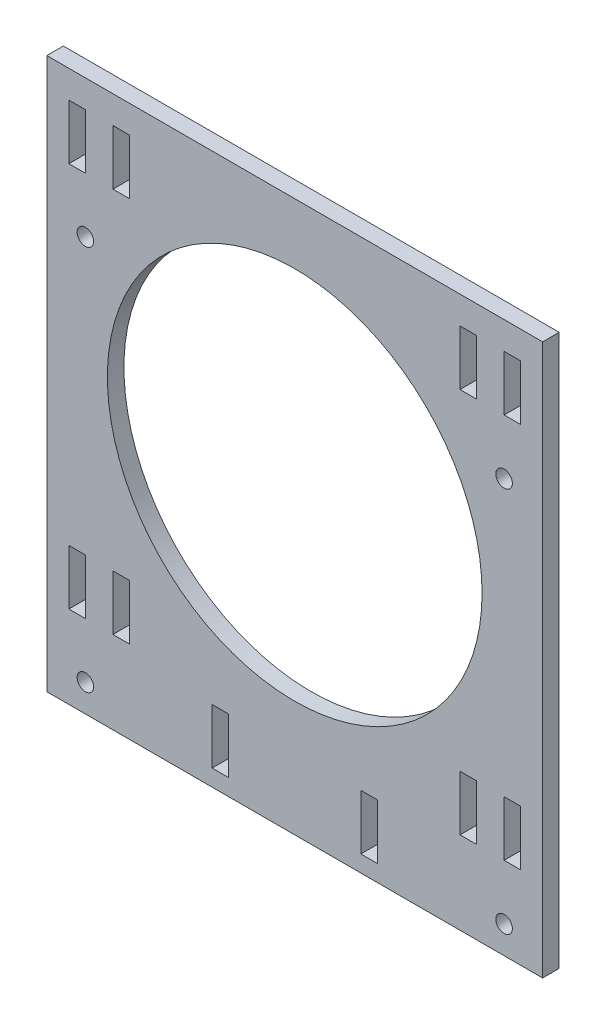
ISO-10303-21;
HEADER;
FILE_DESCRIPTION(('STEP AP214'),'2;1');
FILE_NAME('part.step','',(''),(''),'','','');
FILE_SCHEMA(('AUTOMOTIVE_DESIGN { 1 0 10303 214 1 1 1 1 }'));
ENDSEC;
DATA;
#1=APPLICATION_CONTEXT('core data for automotive mechanical design processes');
#2=APPLICATION_PROTOCOL_DEFINITION('international standard','automotive_design',2000,#1);
#3=PRODUCT_CONTEXT('',#1,'mechanical');
#4=PRODUCT('Part','Part','',(#3));
#5=PRODUCT_RELATED_PRODUCT_CATEGORY('part','',(#4));
#6=PRODUCT_DEFINITION_FORMATION('','',#4);
#7=PRODUCT_DEFINITION_CONTEXT('part definition',#1,'design');
#8=PRODUCT_DEFINITION('design','',#6,#7);
#9=PRODUCT_DEFINITION_SHAPE('','',#8);
#10=(LENGTH_UNIT() NAMED_UNIT(*) SI_UNIT(.MILLI.,.METRE.));
#11=(NAMED_UNIT(*) PLANE_ANGLE_UNIT() SI_UNIT($,.RADIAN.));
#12=(NAMED_UNIT(*) SI_UNIT($,.STERADIAN.) SOLID_ANGLE_UNIT());
#13=UNCERTAINTY_MEASURE_WITH_UNIT(LENGTH_MEASURE(1.E-05),#10,'distance_accuracy_value','');
#14=(GEOMETRIC_REPRESENTATION_CONTEXT(3) GLOBAL_UNCERTAINTY_ASSIGNED_CONTEXT((#13)) GLOBAL_UNIT_ASSIGNED_CONTEXT((#10,
#11,#12)) REPRESENTATION_CONTEXT('',''));
#15=CARTESIAN_POINT('',(0.,0.,0.));
#16=DIRECTION('',(0.,0.,1.));
#17=DIRECTION('',(1.,0.,0.));
#18=AXIS2_PLACEMENT_3D('',#15,#16,#17);
#19=CARTESIAN_POINT('',(44.9999999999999,1.2490009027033E-13,3.));
#20=DIRECTION('',(1.,0.,0.));
#21=DIRECTION('',(0.,1.,0.));
#22=AXIS2_PLACEMENT_3D('',#19,#20,#21);
#23=PLANE('',#22);
#24=DIRECTION('',(0.,-1.,0.));
#25=VECTOR('',#24,1.);
#26=CARTESIAN_POINT('',(44.9999999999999,1.2490009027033E-13,0.));
#27=LINE('',#26,#25);
#28=CARTESIAN_POINT('',(45.,45.,0.));
#29=VERTEX_POINT('',#28);
#30=CARTESIAN_POINT('',(45.,-55.,0.));
#31=VERTEX_POINT('',#30);
#32=EDGE_CURVE('E610',#29,#31,#27,.T.);
#33=ORIENTED_EDGE('',*,*,#32,.F.);
#34=DIRECTION('',(0.,0.,-1.));
#35=VECTOR('',#34,1.);
#36=CARTESIAN_POINT('',(45.,45.,3.));
#37=LINE('',#36,#35);
#38=CARTESIAN_POINT('',(45.,45.,3.));
#39=VERTEX_POINT('',#38);
#40=EDGE_CURVE('E626',#39,#29,#37,.T.);
#41=ORIENTED_EDGE('',*,*,#40,.F.);
#42=DIRECTION('',(0.,-1.,0.));
#43=VECTOR('',#42,1.);
#44=CARTESIAN_POINT('',(44.9999999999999,1.2490009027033E-13,3.));
#45=LINE('',#44,#43);
#46=CARTESIAN_POINT('',(45.,-55.,3.));
#47=VERTEX_POINT('',#46);
#48=EDGE_CURVE('E595',#39,#47,#45,.T.);
#49=ORIENTED_EDGE('',*,*,#48,.T.);
#50=DIRECTION('',(0.,0.,-1.));
#51=VECTOR('',#50,1.);
#52=CARTESIAN_POINT('',(45.,-55.,3.));
#53=LINE('',#52,#51);
#54=EDGE_CURVE('E607',#47,#31,#53,.T.);
#55=ORIENTED_EDGE('',*,*,#54,.T.);
#56=EDGE_LOOP('',(#33,#41,#49,#55));
#57=FACE_BOUND('',#56,.T.);
#58=ADVANCED_FACE('F35',(#57),#23,.T.);
#59=CARTESIAN_POINT('',(0.,45.,3.));
#60=DIRECTION('',(0.,1.,0.));
#61=DIRECTION('',(0.,0.,1.));
#62=AXIS2_PLACEMENT_3D('',#59,#60,#61);
#63=PLANE('',#62);
#64=DIRECTION('',(1.,0.,0.));
#65=VECTOR('',#64,1.);
#66=CARTESIAN_POINT('',(0.,45.,0.));
#67=LINE('',#66,#65);
#68=CARTESIAN_POINT('',(-45.,45.,0.));
#69=VERTEX_POINT('',#68);
#70=EDGE_CURVE('E613',#69,#29,#67,.T.);
#71=ORIENTED_EDGE('',*,*,#70,.F.);
#72=DIRECTION('',(0.,0.,-1.));
#73=VECTOR('',#72,1.);
#74=CARTESIAN_POINT('',(-45.,45.,3.));
#75=LINE('',#74,#73);
#76=CARTESIAN_POINT('',(-45.,45.,3.));
#77=VERTEX_POINT('',#76);
#78=EDGE_CURVE('E624',#77,#69,#75,.T.);
#79=ORIENTED_EDGE('',*,*,#78,.F.);
#80=DIRECTION('',(1.,0.,0.));
#81=VECTOR('',#80,1.);
#82=CARTESIAN_POINT('',(0.,45.,3.));
#83=LINE('',#82,#81);
#84=EDGE_CURVE('E599',#77,#39,#83,.T.);
#85=ORIENTED_EDGE('',*,*,#84,.T.);
#86=ORIENTED_EDGE('',*,*,#40,.T.);
#87=EDGE_LOOP('',(#71,#79,#85,#86));
#88=FACE_BOUND('',#87,.T.);
#89=ADVANCED_FACE('F733',(#88),#63,.T.);
#90=CARTESIAN_POINT('',(-45.,0.,3.));
#91=DIRECTION('',(-1.,0.,0.));
#92=DIRECTION('',(0.,-1.,0.));
#93=AXIS2_PLACEMENT_3D('',#90,#91,#92);
#94=PLANE('',#93);
#95=DIRECTION('',(0.,1.,0.));
#96=VECTOR('',#95,1.);
#97=CARTESIAN_POINT('',(-45.,0.,0.));
#98=LINE('',#97,#96);
#99=CARTESIAN_POINT('',(-45.,-55.,0.));
#100=VERTEX_POINT('',#99);
#101=EDGE_CURVE('E616',#100,#69,#98,.T.);
#102=ORIENTED_EDGE('',*,*,#101,.F.);
#103=DIRECTION('',(0.,0.,-1.));
#104=VECTOR('',#103,1.);
#105=CARTESIAN_POINT('',(-45.,-55.,3.));
#106=LINE('',#105,#104);
#107=CARTESIAN_POINT('',(-45.,-55.,3.));
#108=VERTEX_POINT('',#107);
#109=EDGE_CURVE('E622',#108,#100,#106,.T.);
#110=ORIENTED_EDGE('',*,*,#109,.F.);
#111=DIRECTION('',(0.,1.,0.));
#112=VECTOR('',#111,1.);
#113=CARTESIAN_POINT('',(-45.,0.,3.));
#114=LINE('',#113,#112);
#115=EDGE_CURVE('E602',#108,#77,#114,.T.);
#116=ORIENTED_EDGE('',*,*,#115,.T.);
#117=ORIENTED_EDGE('',*,*,#78,.T.);
#118=EDGE_LOOP('',(#102,#110,#116,#117));
#119=FACE_BOUND('',#118,.T.);
#120=ADVANCED_FACE('F738',(#119),#94,.T.);
#121=CARTESIAN_POINT('',(0.,0.,3.));
#122=DIRECTION('',(0.,0.,-1.));
#123=DIRECTION('',(-1.,0.,0.));
#124=AXIS2_PLACEMENT_3D('',#121,#122,#123);
#125=CYLINDRICAL_SURFACE('',#124,33.9999999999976);
#126=CARTESIAN_POINT('',(0.,0.,3.));
#127=DIRECTION('',(0.,0.,1.));
#128=DIRECTION('',(1.,0.,0.));
#129=AXIS2_PLACEMENT_3D('',#126,#127,#128);
#130=CIRCLE('',#129,33.9999999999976);
#131=CARTESIAN_POINT('',(33.9999999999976,0.,3.));
#132=VERTEX_POINT('',#131);
#133=EDGE_CURVE('E592',#132,#132,#130,.T.);
#134=ORIENTED_EDGE('',*,*,#133,.T.);
#135=EDGE_LOOP('',(#134));
#136=FACE_BOUND('',#135,.T.);
#137=CARTESIAN_POINT('',(0.,0.,0.));
#138=DIRECTION('',(0.,0.,1.));
#139=DIRECTION('',(1.,0.,0.));
#140=AXIS2_PLACEMENT_3D('',#137,#138,#139);
#141=CIRCLE('',#140,33.9999999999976);
#142=CARTESIAN_POINT('',(33.9999999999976,0.,0.));
#143=VERTEX_POINT('',#142);
#144=EDGE_CURVE('E585',#143,#143,#141,.T.);
#145=ORIENTED_EDGE('',*,*,#144,.F.);
#146=EDGE_LOOP('',(#145));
#147=FACE_BOUND('',#146,.T.);
#148=ADVANCED_FACE('F37',(#136,#147),#125,.F.);
#149=CARTESIAN_POINT('',(0.,-55.,3.));
#150=DIRECTION('',(0.,1.,0.));
#151=DIRECTION('',(0.,0.,1.));
#152=AXIS2_PLACEMENT_3D('',#149,#150,#151);
#153=PLANE('',#152);
#154=DIRECTION('',(1.,0.,0.));
#155=VECTOR('',#154,1.);
#156=CARTESIAN_POINT('',(0.,-55.,0.));
#157=LINE('',#156,#155);
#158=EDGE_CURVE('E596',#100,#31,#157,.T.);
#159=ORIENTED_EDGE('',*,*,#158,.T.);
#160=ORIENTED_EDGE('',*,*,#54,.F.);
#161=DIRECTION('',(1.,0.,0.));
#162=VECTOR('',#161,1.);
#163=CARTESIAN_POINT('',(0.,-55.,3.));
#164=LINE('',#163,#162);
#165=EDGE_CURVE('E605',#108,#47,#164,.T.);
#166=ORIENTED_EDGE('',*,*,#165,.F.);
#167=ORIENTED_EDGE('',*,*,#109,.T.);
#168=EDGE_LOOP('',(#159,#160,#166,#167));
#169=FACE_BOUND('',#168,.T.);
#170=ADVANCED_FACE('F746',(#169),#153,.F.);
#171=CARTESIAN_POINT('',(0.,0.,3.));
#172=DIRECTION('',(0.,0.,1.));
#173=DIRECTION('',(1.,0.,0.));
#174=AXIS2_PLACEMENT_3D('',#171,#172,#173);
#175=PLANE('',#174);
#176=DIRECTION('',(-1.,0.,0.));
#177=VECTOR('',#176,1.);
#178=CARTESIAN_POINT('',(-15.,-42.,3.));
#179=LINE('',#178,#177);
#180=CARTESIAN_POINT('',(-12.,-42.,3.));
#181=VERTEX_POINT('',#180);
#182=CARTESIAN_POINT('',(-15.,-42.,3.));
#183=VERTEX_POINT('',#182);
#184=EDGE_CURVE('E50',#181,#183,#179,.T.);
#185=ORIENTED_EDGE('',*,*,#184,.F.);
#186=DIRECTION('',(0.,1.,0.));
#187=VECTOR('',#186,1.);
#188=CARTESIAN_POINT('',(-12.,-52.,3.));
#189=LINE('',#188,#187);
#190=CARTESIAN_POINT('',(-12.,-52.,3.));
#191=VERTEX_POINT('',#190);
#192=EDGE_CURVE('E367',#191,#181,#189,.T.);
#193=ORIENTED_EDGE('',*,*,#192,.F.);
#194=DIRECTION('',(1.,0.,0.));
#195=VECTOR('',#194,1.);
#196=CARTESIAN_POINT('',(-15.,-52.,3.));
#197=LINE('',#196,#195);
#198=CARTESIAN_POINT('',(-15.,-52.,3.));
#199=VERTEX_POINT('',#198);
#200=EDGE_CURVE('E364',#199,#191,#197,.T.);
#201=ORIENTED_EDGE('',*,*,#200,.F.);
#202=DIRECTION('',(0.,-1.,0.));
#203=VECTOR('',#202,1.);
#204=CARTESIAN_POINT('',(-15.,-42.,3.));
#205=LINE('',#204,#203);
#206=EDGE_CURVE('E360',#183,#199,#205,.T.);
#207=ORIENTED_EDGE('',*,*,#206,.F.);
#208=EDGE_LOOP('',(#185,#193,#201,#207));
#209=FACE_BOUND('',#208,.T.);
#210=CARTESIAN_POINT('',(-38.,20.,3.));
#211=DIRECTION('',(0.,0.,1.));
#212=DIRECTION('',(1.,0.,0.));
#213=AXIS2_PLACEMENT_3D('',#210,#211,#212);
#214=CIRCLE('',#213,1.5);
#215=CARTESIAN_POINT('',(-36.5,20.,3.));
#216=VERTEX_POINT('',#215);
#217=EDGE_CURVE('E354',#216,#216,#214,.T.);
#218=ORIENTED_EDGE('',*,*,#217,.F.);
#219=EDGE_LOOP('',(#218));
#220=FACE_BOUND('',#219,.T.);
#221=CARTESIAN_POINT('',(-38.,-50.,3.));
#222=DIRECTION('',(0.,0.,1.));
#223=DIRECTION('',(1.,0.,0.));
#224=AXIS2_PLACEMENT_3D('',#221,#222,#223);
#225=CIRCLE('',#224,1.5);
#226=CARTESIAN_POINT('',(-36.5,-50.,3.));
#227=VERTEX_POINT('',#226);
#228=EDGE_CURVE('E357',#227,#227,#225,.T.);
#229=ORIENTED_EDGE('',*,*,#228,.F.);
#230=EDGE_LOOP('',(#229));
#231=FACE_BOUND('',#230,.T.);
#232=DIRECTION('',(0.,1.,0.));
#233=VECTOR('',#232,1.);
#234=CARTESIAN_POINT('',(-38.,30.,3.));
#235=LINE('',#234,#233);
#236=CARTESIAN_POINT('',(-38.,30.,3.));
#237=VERTEX_POINT('',#236);
#238=CARTESIAN_POINT('',(-38.,40.,3.));
#239=VERTEX_POINT('',#238);
#240=EDGE_CURVE('E58',#237,#239,#235,.T.);
#241=ORIENTED_EDGE('',*,*,#240,.F.);
#242=DIRECTION('',(1.,0.,0.));
#243=VECTOR('',#242,1.);
#244=CARTESIAN_POINT('',(-41.,30.,3.));
#245=LINE('',#244,#243);
#246=CARTESIAN_POINT('',(-41.,30.,3.));
#247=VERTEX_POINT('',#246);
#248=EDGE_CURVE('E384',#247,#237,#245,.T.);
#249=ORIENTED_EDGE('',*,*,#248,.F.);
#250=DIRECTION('',(0.,-1.,0.));
#251=VECTOR('',#250,1.);
#252=CARTESIAN_POINT('',(-41.,40.,3.));
#253=LINE('',#252,#251);
#254=CARTESIAN_POINT('',(-41.,40.,3.));
#255=VERTEX_POINT('',#254);
#256=EDGE_CURVE('E381',#255,#247,#253,.T.);
#257=ORIENTED_EDGE('',*,*,#256,.F.);
#258=DIRECTION('',(-1.,0.,0.));
#259=VECTOR('',#258,1.);
#260=CARTESIAN_POINT('',(-38.,40.,3.));
#261=LINE('',#260,#259);
#262=EDGE_CURVE('E378',#239,#255,#261,.T.);
#263=ORIENTED_EDGE('',*,*,#262,.F.);
#264=EDGE_LOOP('',(#241,#249,#257,#263));
#265=FACE_BOUND('',#264,.T.);
#266=DIRECTION('',(0.,-1.,0.));
#267=VECTOR('',#266,1.);
#268=CARTESIAN_POINT('',(38.,30.,3.));
#269=LINE('',#268,#267);
#270=CARTESIAN_POINT('',(38.,40.,3.));
#271=VERTEX_POINT('',#270);
#272=CARTESIAN_POINT('',(38.,30.,3.));
#273=VERTEX_POINT('',#272);
#274=EDGE_CURVE('E351',#271,#273,#269,.T.);
#275=ORIENTED_EDGE('',*,*,#274,.F.);
#276=DIRECTION('',(-1.,0.,0.));
#277=VECTOR('',#276,1.);
#278=CARTESIAN_POINT('',(38.,40.,3.));
#279=LINE('',#278,#277);
#280=CARTESIAN_POINT('',(41.,40.,3.));
#281=VERTEX_POINT('',#280);
#282=EDGE_CURVE('E427',#281,#271,#279,.T.);
#283=ORIENTED_EDGE('',*,*,#282,.F.);
#284=DIRECTION('',(0.,1.,0.));
#285=VECTOR('',#284,1.);
#286=CARTESIAN_POINT('',(41.,40.,3.));
#287=LINE('',#286,#285);
#288=CARTESIAN_POINT('',(41.,30.,3.));
#289=VERTEX_POINT('',#288);
#290=EDGE_CURVE('E424',#289,#281,#287,.T.);
#291=ORIENTED_EDGE('',*,*,#290,.F.);
#292=DIRECTION('',(1.,0.,0.));
#293=VECTOR('',#292,1.);
#294=CARTESIAN_POINT('',(41.,30.,3.));
#295=LINE('',#294,#293);
#296=EDGE_CURVE('E421',#273,#289,#295,.T.);
#297=ORIENTED_EDGE('',*,*,#296,.F.);
#298=EDGE_LOOP('',(#275,#283,#291,#297));
#299=FACE_BOUND('',#298,.T.);
#300=DIRECTION('',(0.,1.,0.));
#301=VECTOR('',#300,1.);
#302=CARTESIAN_POINT('',(15.,-42.,3.));
#303=LINE('',#302,#301);
#304=CARTESIAN_POINT('',(15.,-52.,3.));
#305=VERTEX_POINT('',#304);
#306=CARTESIAN_POINT('',(15.,-42.,3.));
#307=VERTEX_POINT('',#306);
#308=EDGE_CURVE('E398',#305,#307,#303,.T.);
#309=ORIENTED_EDGE('',*,*,#308,.F.);
#310=DIRECTION('',(1.,0.,0.));
#311=VECTOR('',#310,1.);
#312=CARTESIAN_POINT('',(15.,-52.,3.));
#313=LINE('',#312,#311);
#314=CARTESIAN_POINT('',(12.,-52.,3.));
#315=VERTEX_POINT('',#314);
#316=EDGE_CURVE('E407',#315,#305,#313,.T.);
#317=ORIENTED_EDGE('',*,*,#316,.F.);
#318=DIRECTION('',(0.,-1.,0.));
#319=VECTOR('',#318,1.);
#320=CARTESIAN_POINT('',(12.,-52.,3.));
#321=LINE('',#320,#319);
#322=CARTESIAN_POINT('',(12.,-42.,3.));
#323=VERTEX_POINT('',#322);
#324=EDGE_CURVE('E404',#323,#315,#321,.T.);
#325=ORIENTED_EDGE('',*,*,#324,.F.);
#326=DIRECTION('',(-1.,0.,0.));
#327=VECTOR('',#326,1.);
#328=CARTESIAN_POINT('',(15.,-42.,3.));
#329=LINE('',#328,#327);
#330=EDGE_CURVE('E400',#307,#323,#329,.T.);
#331=ORIENTED_EDGE('',*,*,#330,.F.);
#332=EDGE_LOOP('',(#309,#317,#325,#331));
#333=FACE_BOUND('',#332,.T.);
#334=CARTESIAN_POINT('',(38.,-50.,3.));
#335=DIRECTION('',(0.,0.,1.));
#336=DIRECTION('',(-1.,0.,0.));
#337=AXIS2_PLACEMENT_3D('',#334,#335,#336);
#338=CIRCLE('',#337,1.5);
#339=CARTESIAN_POINT('',(36.5,-50.,3.));
#340=VERTEX_POINT('',#339);
#341=EDGE_CURVE('E413',#340,#340,#338,.T.);
#342=ORIENTED_EDGE('',*,*,#341,.F.);
#343=EDGE_LOOP('',(#342));
#344=FACE_BOUND('',#343,.T.);
#345=CARTESIAN_POINT('',(38.,20.,3.));
#346=DIRECTION('',(0.,0.,1.));
#347=DIRECTION('',(-1.,0.,0.));
#348=AXIS2_PLACEMENT_3D('',#345,#346,#347);
#349=CIRCLE('',#348,1.5);
#350=CARTESIAN_POINT('',(36.5,20.,3.));
#351=VERTEX_POINT('',#350);
#352=EDGE_CURVE('E361',#351,#351,#349,.T.);
#353=ORIENTED_EDGE('',*,*,#352,.F.);
#354=EDGE_LOOP('',(#353));
#355=FACE_BOUND('',#354,.T.);
#356=DIRECTION('',(0.,1.,0.));
#357=VECTOR('',#356,1.);
#358=CARTESIAN_POINT('',(41.,-40.,3.));
#359=LINE('',#358,#357);
#360=CARTESIAN_POINT('',(41.,-40.,3.));
#361=VERTEX_POINT('',#360);
#362=CARTESIAN_POINT('',(41.,-30.,3.));
#363=VERTEX_POINT('',#362);
#364=EDGE_CURVE('E339',#361,#363,#359,.T.);
#365=ORIENTED_EDGE('',*,*,#364,.F.);
#366=DIRECTION('',(1.,0.,0.));
#367=VECTOR('',#366,1.);
#368=CARTESIAN_POINT('',(38.,-40.,3.));
#369=LINE('',#368,#367);
#370=CARTESIAN_POINT('',(38.,-40.,3.));
#371=VERTEX_POINT('',#370);
#372=EDGE_CURVE('E344',#371,#361,#369,.T.);
#373=ORIENTED_EDGE('',*,*,#372,.F.);
#374=DIRECTION('',(0.,-1.,0.));
#375=VECTOR('',#374,1.);
#376=CARTESIAN_POINT('',(38.,-30.,3.));
#377=LINE('',#376,#375);
#378=CARTESIAN_POINT('',(38.,-30.,3.));
#379=VERTEX_POINT('',#378);
#380=EDGE_CURVE('E323',#379,#371,#377,.T.);
#381=ORIENTED_EDGE('',*,*,#380,.F.);
#382=DIRECTION('',(-1.,0.,0.));
#383=VECTOR('',#382,1.);
#384=CARTESIAN_POINT('',(41.,-30.,3.));
#385=LINE('',#384,#383);
#386=EDGE_CURVE('E334',#363,#379,#385,.T.);
#387=ORIENTED_EDGE('',*,*,#386,.F.);
#388=EDGE_LOOP('',(#365,#373,#381,#387));
#389=FACE_BOUND('',#388,.T.);
#390=DIRECTION('',(-1.,0.,0.));
#391=VECTOR('',#390,1.);
#392=CARTESIAN_POINT('',(-41.,-30.,3.));
#393=LINE('',#392,#391);
#394=CARTESIAN_POINT('',(-38.,-30.,3.));
#395=VERTEX_POINT('',#394);
#396=CARTESIAN_POINT('',(-41.,-30.,3.));
#397=VERTEX_POINT('',#396);
#398=EDGE_CURVE('E390',#395,#397,#393,.T.);
#399=ORIENTED_EDGE('',*,*,#398,.F.);
#400=DIRECTION('',(0.,1.,0.));
#401=VECTOR('',#400,1.);
#402=CARTESIAN_POINT('',(-38.,-30.,3.));
#403=LINE('',#402,#401);
#404=CARTESIAN_POINT('',(-38.,-40.,3.));
#405=VERTEX_POINT('',#404);
#406=EDGE_CURVE('E449',#405,#395,#403,.T.);
#407=ORIENTED_EDGE('',*,*,#406,.F.);
#408=DIRECTION('',(1.,0.,0.));
#409=VECTOR('',#408,1.);
#410=CARTESIAN_POINT('',(-38.,-40.,3.));
#411=LINE('',#410,#409);
#412=CARTESIAN_POINT('',(-41.,-40.,3.));
#413=VERTEX_POINT('',#412);
#414=EDGE_CURVE('E446',#413,#405,#411,.T.);
#415=ORIENTED_EDGE('',*,*,#414,.F.);
#416=DIRECTION('',(0.,-1.,0.));
#417=VECTOR('',#416,1.);
#418=CARTESIAN_POINT('',(-41.,-40.,3.));
#419=LINE('',#418,#417);
#420=EDGE_CURVE('E443',#397,#413,#419,.T.);
#421=ORIENTED_EDGE('',*,*,#420,.F.);
#422=EDGE_LOOP('',(#399,#407,#415,#421));
#423=FACE_BOUND('',#422,.T.);
#424=DIRECTION('',(-1.,0.,0.));
#425=VECTOR('',#424,1.);
#426=CARTESIAN_POINT('',(33.,40.,3.));
#427=LINE('',#426,#425);
#428=CARTESIAN_POINT('',(33.,40.,3.));
#429=VERTEX_POINT('',#428);
#430=CARTESIAN_POINT('',(30.,40.,3.));
#431=VERTEX_POINT('',#430);
#432=EDGE_CURVE('E510',#429,#431,#427,.T.);
#433=ORIENTED_EDGE('',*,*,#432,.F.);
#434=DIRECTION('',(0.,1.,0.));
#435=VECTOR('',#434,1.);
#436=CARTESIAN_POINT('',(33.,30.,3.));
#437=LINE('',#436,#435);
#438=CARTESIAN_POINT('',(33.,30.,3.));
#439=VERTEX_POINT('',#438);
#440=EDGE_CURVE('E500',#439,#429,#437,.T.);
#441=ORIENTED_EDGE('',*,*,#440,.F.);
#442=DIRECTION('',(1.,0.,0.));
#443=VECTOR('',#442,1.);
#444=CARTESIAN_POINT('',(30.,30.,3.));
#445=LINE('',#444,#443);
#446=CARTESIAN_POINT('',(30.,30.,3.));
#447=VERTEX_POINT('',#446);
#448=EDGE_CURVE('E516',#447,#439,#445,.T.);
#449=ORIENTED_EDGE('',*,*,#448,.F.);
#450=DIRECTION('',(0.,-1.,0.));
#451=VECTOR('',#450,1.);
#452=CARTESIAN_POINT('',(30.,40.,3.));
#453=LINE('',#452,#451);
#454=EDGE_CURVE('E512',#431,#447,#453,.T.);
#455=ORIENTED_EDGE('',*,*,#454,.F.);
#456=EDGE_LOOP('',(#433,#441,#449,#455));
#457=FACE_BOUND('',#456,.T.);
#458=DIRECTION('',(-1.,0.,0.));
#459=VECTOR('',#458,1.);
#460=CARTESIAN_POINT('',(-30.,-30.,3.));
#461=LINE('',#460,#459);
#462=CARTESIAN_POINT('',(-30.,-30.,3.));
#463=VERTEX_POINT('',#462);
#464=CARTESIAN_POINT('',(-33.,-30.,3.));
#465=VERTEX_POINT('',#464);
#466=EDGE_CURVE('E489',#463,#465,#461,.T.);
#467=ORIENTED_EDGE('',*,*,#466,.F.);
#468=DIRECTION('',(0.,1.,0.));
#469=VECTOR('',#468,1.);
#470=CARTESIAN_POINT('',(-30.,-40.,3.));
#471=LINE('',#470,#469);
#472=CARTESIAN_POINT('',(-30.,-40.,3.));
#473=VERTEX_POINT('',#472);
#474=EDGE_CURVE('E534',#473,#463,#471,.T.);
#475=ORIENTED_EDGE('',*,*,#474,.F.);
#476=DIRECTION('',(1.,0.,0.));
#477=VECTOR('',#476,1.);
#478=CARTESIAN_POINT('',(-33.,-40.,3.));
#479=LINE('',#478,#477);
#480=CARTESIAN_POINT('',(-33.,-40.,3.));
#481=VERTEX_POINT('',#480);
#482=EDGE_CURVE('E548',#481,#473,#479,.T.);
#483=ORIENTED_EDGE('',*,*,#482,.F.);
#484=DIRECTION('',(0.,-1.,0.));
#485=VECTOR('',#484,1.);
#486=CARTESIAN_POINT('',(-33.,-30.,3.));
#487=LINE('',#486,#485);
#488=EDGE_CURVE('E545',#465,#481,#487,.T.);
#489=ORIENTED_EDGE('',*,*,#488,.F.);
#490=EDGE_LOOP('',(#467,#475,#483,#489));
#491=FACE_BOUND('',#490,.T.);
#492=DIRECTION('',(-1.,0.,0.));
#493=VECTOR('',#492,1.);
#494=CARTESIAN_POINT('',(33.,-30.,3.));
#495=LINE('',#494,#493);
#496=CARTESIAN_POINT('',(33.,-30.,3.));
#497=VERTEX_POINT('',#496);
#498=CARTESIAN_POINT('',(30.,-30.,3.));
#499=VERTEX_POINT('',#498);
#500=EDGE_CURVE('E476',#497,#499,#495,.T.);
#501=ORIENTED_EDGE('',*,*,#500,.F.);
#502=DIRECTION('',(0.,1.,0.));
#503=VECTOR('',#502,1.);
#504=CARTESIAN_POINT('',(33.,-40.,3.));
#505=LINE('',#504,#503);
#506=CARTESIAN_POINT('',(33.,-40.,3.));
#507=VERTEX_POINT('',#506);
#508=EDGE_CURVE('E466',#507,#497,#505,.T.);
#509=ORIENTED_EDGE('',*,*,#508,.F.);
#510=DIRECTION('',(1.,0.,0.));
#511=VECTOR('',#510,1.);
#512=CARTESIAN_POINT('',(30.,-40.,3.));
#513=LINE('',#512,#511);
#514=CARTESIAN_POINT('',(30.,-40.,3.));
#515=VERTEX_POINT('',#514);
#516=EDGE_CURVE('E482',#515,#507,#513,.T.);
#517=ORIENTED_EDGE('',*,*,#516,.F.);
#518=DIRECTION('',(0.,-1.,0.));
#519=VECTOR('',#518,1.);
#520=CARTESIAN_POINT('',(30.,-30.,3.));
#521=LINE('',#520,#519);
#522=EDGE_CURVE('E478',#499,#515,#521,.T.);
#523=ORIENTED_EDGE('',*,*,#522,.F.);
#524=EDGE_LOOP('',(#501,#509,#517,#523));
#525=FACE_BOUND('',#524,.T.);
#526=DIRECTION('',(-1.,0.,0.));
#527=VECTOR('',#526,1.);
#528=CARTESIAN_POINT('',(-30.,40.,3.));
#529=LINE('',#528,#527);
#530=CARTESIAN_POINT('',(-30.,40.,3.));
#531=VERTEX_POINT('',#530);
#532=CARTESIAN_POINT('',(-33.,40.,3.));
#533=VERTEX_POINT('',#532);
#534=EDGE_CURVE('E523',#531,#533,#529,.T.);
#535=ORIENTED_EDGE('',*,*,#534,.F.);
#536=DIRECTION('',(0.,1.,0.));
#537=VECTOR('',#536,1.);
#538=CARTESIAN_POINT('',(-30.,30.,3.));
#539=LINE('',#538,#537);
#540=CARTESIAN_POINT('',(-30.,30.,3.));
#541=VERTEX_POINT('',#540);
#542=EDGE_CURVE('E564',#541,#531,#539,.T.);
#543=ORIENTED_EDGE('',*,*,#542,.F.);
#544=DIRECTION('',(1.,0.,0.));
#545=VECTOR('',#544,1.);
#546=CARTESIAN_POINT('',(-33.,30.,3.));
#547=LINE('',#546,#545);
#548=CARTESIAN_POINT('',(-33.,30.,3.));
#549=VERTEX_POINT('',#548);
#550=EDGE_CURVE('E578',#549,#541,#547,.T.);
#551=ORIENTED_EDGE('',*,*,#550,.F.);
#552=DIRECTION('',(0.,-1.,0.));
#553=VECTOR('',#552,1.);
#554=CARTESIAN_POINT('',(-33.,40.,3.));
#555=LINE('',#554,#553);
#556=EDGE_CURVE('E575',#533,#549,#555,.T.);
#557=ORIENTED_EDGE('',*,*,#556,.F.);
#558=EDGE_LOOP('',(#535,#543,#551,#557));
#559=FACE_BOUND('',#558,.T.);
#560=ORIENTED_EDGE('',*,*,#133,.F.);
#561=EDGE_LOOP('',(#560));
#562=FACE_BOUND('',#561,.T.);
#563=ORIENTED_EDGE('',*,*,#48,.F.);
#564=ORIENTED_EDGE('',*,*,#84,.F.);
#565=ORIENTED_EDGE('',*,*,#115,.F.);
#566=ORIENTED_EDGE('',*,*,#165,.T.);
#567=EDGE_LOOP('',(#563,#564,#565,#566));
#568=FACE_BOUND('',#567,.T.);
#569=ADVANCED_FACE('F341',(#209,#220,#231,#265,#299,#333,#344,#355,#389,#423,#457,#491,#525,
#559,#562,#568),#175,.T.);
#570=CARTESIAN_POINT('',(0.,0.,0.));
#571=DIRECTION('',(0.,0.,1.));
#572=DIRECTION('',(1.,0.,0.));
#573=AXIS2_PLACEMENT_3D('',#570,#571,#572);
#574=PLANE('',#573);
#575=DIRECTION('',(0.,1.,0.));
#576=VECTOR('',#575,1.);
#577=CARTESIAN_POINT('',(-12.,0.,0.));
#578=LINE('',#577,#576);
#579=CARTESIAN_POINT('',(-12.,-52.,0.));
#580=VERTEX_POINT('',#579);
#581=CARTESIAN_POINT('',(-12.,-42.,0.));
#582=VERTEX_POINT('',#581);
#583=EDGE_CURVE('E43',#580,#582,#578,.T.);
#584=ORIENTED_EDGE('',*,*,#583,.T.);
#585=DIRECTION('',(-1.,0.,0.));
#586=VECTOR('',#585,1.);
#587=CARTESIAN_POINT('',(0.,-42.,0.));
#588=LINE('',#587,#586);
#589=CARTESIAN_POINT('',(-15.,-42.,0.));
#590=VERTEX_POINT('',#589);
#591=EDGE_CURVE('E11',#582,#590,#588,.T.);
#592=ORIENTED_EDGE('',*,*,#591,.T.);
#593=DIRECTION('',(0.,-1.,0.));
#594=VECTOR('',#593,1.);
#595=CARTESIAN_POINT('',(-15.,0.,0.));
#596=LINE('',#595,#594);
#597=CARTESIAN_POINT('',(-15.,-52.,0.));
#598=VERTEX_POINT('',#597);
#599=EDGE_CURVE('E691',#590,#598,#596,.T.);
#600=ORIENTED_EDGE('',*,*,#599,.T.);
#601=DIRECTION('',(1.,0.,0.));
#602=VECTOR('',#601,1.);
#603=CARTESIAN_POINT('',(0.,-52.,0.));
#604=LINE('',#603,#602);
#605=EDGE_CURVE('E698',#598,#580,#604,.T.);
#606=ORIENTED_EDGE('',*,*,#605,.T.);
#607=EDGE_LOOP('',(#584,#592,#600,#606));
#608=FACE_BOUND('',#607,.T.);
#609=CARTESIAN_POINT('',(-38.,20.,0.));
#610=DIRECTION('',(0.,0.,1.));
#611=DIRECTION('',(1.,0.,0.));
#612=AXIS2_PLACEMENT_3D('',#609,#610,#611);
#613=CIRCLE('',#612,1.5);
#614=CARTESIAN_POINT('',(-36.5,20.,0.));
#615=VERTEX_POINT('',#614);
#616=EDGE_CURVE('E479',#615,#615,#613,.T.);
#617=ORIENTED_EDGE('',*,*,#616,.T.);
#618=EDGE_LOOP('',(#617));
#619=FACE_BOUND('',#618,.T.);
#620=CARTESIAN_POINT('',(-38.,-50.,0.));
#621=DIRECTION('',(0.,0.,1.));
#622=DIRECTION('',(1.,0.,0.));
#623=AXIS2_PLACEMENT_3D('',#620,#621,#622);
#624=CIRCLE('',#623,1.5);
#625=CARTESIAN_POINT('',(-36.5,-50.,0.));
#626=VERTEX_POINT('',#625);
#627=EDGE_CURVE('E655',#626,#626,#624,.T.);
#628=ORIENTED_EDGE('',*,*,#627,.T.);
#629=EDGE_LOOP('',(#628));
#630=FACE_BOUND('',#629,.T.);
#631=DIRECTION('',(1.,0.,0.));
#632=VECTOR('',#631,1.);
#633=CARTESIAN_POINT('',(0.,30.,0.));
#634=LINE('',#633,#632);
#635=CARTESIAN_POINT('',(-41.,30.,0.));
#636=VERTEX_POINT('',#635);
#637=CARTESIAN_POINT('',(-38.,30.,0.));
#638=VERTEX_POINT('',#637);
#639=EDGE_CURVE('E685',#636,#638,#634,.T.);
#640=ORIENTED_EDGE('',*,*,#639,.T.);
#641=DIRECTION('',(0.,1.,0.));
#642=VECTOR('',#641,1.);
#643=CARTESIAN_POINT('',(-38.,0.,0.));
#644=LINE('',#643,#642);
#645=CARTESIAN_POINT('',(-38.,40.,0.));
#646=VERTEX_POINT('',#645);
#647=EDGE_CURVE('E688',#638,#646,#644,.T.);
#648=ORIENTED_EDGE('',*,*,#647,.T.);
#649=DIRECTION('',(-1.,0.,0.));
#650=VECTOR('',#649,1.);
#651=CARTESIAN_POINT('',(0.,40.,0.));
#652=LINE('',#651,#650);
#653=CARTESIAN_POINT('',(-41.,40.,0.));
#654=VERTEX_POINT('',#653);
#655=EDGE_CURVE('E679',#646,#654,#652,.T.);
#656=ORIENTED_EDGE('',*,*,#655,.T.);
#657=DIRECTION('',(0.,-1.,0.));
#658=VECTOR('',#657,1.);
#659=CARTESIAN_POINT('',(-41.,0.,0.));
#660=LINE('',#659,#658);
#661=EDGE_CURVE('E682',#654,#636,#660,.T.);
#662=ORIENTED_EDGE('',*,*,#661,.T.);
#663=EDGE_LOOP('',(#640,#648,#656,#662));
#664=FACE_BOUND('',#663,.T.);
#665=DIRECTION('',(-1.,0.,0.));
#666=VECTOR('',#665,1.);
#667=CARTESIAN_POINT('',(0.,40.,0.));
#668=LINE('',#667,#666);
#669=CARTESIAN_POINT('',(41.,40.,0.));
#670=VERTEX_POINT('',#669);
#671=CARTESIAN_POINT('',(38.,40.,0.));
#672=VERTEX_POINT('',#671);
#673=EDGE_CURVE('E673',#670,#672,#668,.T.);
#674=ORIENTED_EDGE('',*,*,#673,.T.);
#675=DIRECTION('',(0.,-1.,0.));
#676=VECTOR('',#675,1.);
#677=CARTESIAN_POINT('',(38.,0.,0.));
#678=LINE('',#677,#676);
#679=CARTESIAN_POINT('',(38.,30.,0.));
#680=VERTEX_POINT('',#679);
#681=EDGE_CURVE('E676',#672,#680,#678,.T.);
#682=ORIENTED_EDGE('',*,*,#681,.T.);
#683=DIRECTION('',(1.,0.,0.));
#684=VECTOR('',#683,1.);
#685=CARTESIAN_POINT('',(0.,30.,0.));
#686=LINE('',#685,#684);
#687=CARTESIAN_POINT('',(41.,30.,0.));
#688=VERTEX_POINT('',#687);
#689=EDGE_CURVE('E667',#680,#688,#686,.T.);
#690=ORIENTED_EDGE('',*,*,#689,.T.);
#691=DIRECTION('',(0.,1.,0.));
#692=VECTOR('',#691,1.);
#693=CARTESIAN_POINT('',(41.,0.,0.));
#694=LINE('',#693,#692);
#695=EDGE_CURVE('E670',#688,#670,#694,.T.);
#696=ORIENTED_EDGE('',*,*,#695,.T.);
#697=EDGE_LOOP('',(#674,#682,#690,#696));
#698=FACE_BOUND('',#697,.T.);
#699=DIRECTION('',(1.,0.,0.));
#700=VECTOR('',#699,1.);
#701=CARTESIAN_POINT('',(0.,-52.,0.));
#702=LINE('',#701,#700);
#703=CARTESIAN_POINT('',(12.,-52.,0.));
#704=VERTEX_POINT('',#703);
#705=CARTESIAN_POINT('',(15.,-52.,0.));
#706=VERTEX_POINT('',#705);
#707=EDGE_CURVE('E661',#704,#706,#702,.T.);
#708=ORIENTED_EDGE('',*,*,#707,.T.);
#709=DIRECTION('',(0.,1.,0.));
#710=VECTOR('',#709,1.);
#711=CARTESIAN_POINT('',(15.,0.,0.));
#712=LINE('',#711,#710);
#713=CARTESIAN_POINT('',(15.,-42.,0.));
#714=VERTEX_POINT('',#713);
#715=EDGE_CURVE('E664',#706,#714,#712,.T.);
#716=ORIENTED_EDGE('',*,*,#715,.T.);
#717=DIRECTION('',(-1.,0.,0.));
#718=VECTOR('',#717,1.);
#719=CARTESIAN_POINT('',(0.,-42.,0.));
#720=LINE('',#719,#718);
#721=CARTESIAN_POINT('',(12.,-42.,0.));
#722=VERTEX_POINT('',#721);
#723=EDGE_CURVE('E649',#714,#722,#720,.T.);
#724=ORIENTED_EDGE('',*,*,#723,.T.);
#725=DIRECTION('',(0.,-1.,0.));
#726=VECTOR('',#725,1.);
#727=CARTESIAN_POINT('',(12.,0.,0.));
#728=LINE('',#727,#726);
#729=EDGE_CURVE('E658',#722,#704,#728,.T.);
#730=ORIENTED_EDGE('',*,*,#729,.T.);
#731=EDGE_LOOP('',(#708,#716,#724,#730));
#732=FACE_BOUND('',#731,.T.);
#733=CARTESIAN_POINT('',(38.,-50.,0.));
#734=DIRECTION('',(0.,0.,1.));
#735=DIRECTION('',(1.,0.,0.));
#736=AXIS2_PLACEMENT_3D('',#733,#734,#735);
#737=CIRCLE('',#736,1.5);
#738=CARTESIAN_POINT('',(39.5,-50.,0.));
#739=VERTEX_POINT('',#738);
#740=EDGE_CURVE('E652',#739,#739,#737,.T.);
#741=ORIENTED_EDGE('',*,*,#740,.T.);
#742=EDGE_LOOP('',(#741));
#743=FACE_BOUND('',#742,.T.);
#744=CARTESIAN_POINT('',(38.,20.,0.));
#745=DIRECTION('',(0.,0.,1.));
#746=DIRECTION('',(1.,0.,0.));
#747=AXIS2_PLACEMENT_3D('',#744,#745,#746);
#748=CIRCLE('',#747,1.5);
#749=CARTESIAN_POINT('',(39.5,20.,0.));
#750=VERTEX_POINT('',#749);
#751=EDGE_CURVE('E455',#750,#750,#748,.T.);
#752=ORIENTED_EDGE('',*,*,#751,.T.);
#753=EDGE_LOOP('',(#752));
#754=FACE_BOUND('',#753,.T.);
#755=DIRECTION('',(1.,0.,0.));
#756=VECTOR('',#755,1.);
#757=CARTESIAN_POINT('',(0.,-40.,0.));
#758=LINE('',#757,#756);
#759=CARTESIAN_POINT('',(38.,-40.,0.));
#760=VERTEX_POINT('',#759);
#761=CARTESIAN_POINT('',(41.,-40.,0.));
#762=VERTEX_POINT('',#761);
#763=EDGE_CURVE('E643',#760,#762,#758,.T.);
#764=ORIENTED_EDGE('',*,*,#763,.T.);
#765=DIRECTION('',(0.,1.,0.));
#766=VECTOR('',#765,1.);
#767=CARTESIAN_POINT('',(40.9999999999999,0.,0.));
#768=LINE('',#767,#766);
#769=CARTESIAN_POINT('',(41.,-30.,0.));
#770=VERTEX_POINT('',#769);
#771=EDGE_CURVE('E646',#762,#770,#768,.T.);
#772=ORIENTED_EDGE('',*,*,#771,.T.);
#773=DIRECTION('',(-1.,0.,0.));
#774=VECTOR('',#773,1.);
#775=CARTESIAN_POINT('',(0.,-30.,0.));
#776=LINE('',#775,#774);
#777=CARTESIAN_POINT('',(38.,-30.,0.));
#778=VERTEX_POINT('',#777);
#779=EDGE_CURVE('E640',#770,#778,#776,.T.);
#780=ORIENTED_EDGE('',*,*,#779,.T.);
#781=DIRECTION('',(0.,-1.,0.));
#782=VECTOR('',#781,1.);
#783=CARTESIAN_POINT('',(37.9999999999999,0.,0.));
#784=LINE('',#783,#782);
#785=EDGE_CURVE('E326',#778,#760,#784,.T.);
#786=ORIENTED_EDGE('',*,*,#785,.T.);
#787=EDGE_LOOP('',(#764,#772,#780,#786));
#788=FACE_BOUND('',#787,.T.);
#789=DIRECTION('',(0.,1.,0.));
#790=VECTOR('',#789,1.);
#791=CARTESIAN_POINT('',(-38.,0.,0.));
#792=LINE('',#791,#790);
#793=CARTESIAN_POINT('',(-38.,-40.,0.));
#794=VERTEX_POINT('',#793);
#795=CARTESIAN_POINT('',(-38.,-30.,0.));
#796=VERTEX_POINT('',#795);
#797=EDGE_CURVE('E634',#794,#796,#792,.T.);
#798=ORIENTED_EDGE('',*,*,#797,.T.);
#799=DIRECTION('',(-1.,0.,0.));
#800=VECTOR('',#799,1.);
#801=CARTESIAN_POINT('',(0.,-30.,0.));
#802=LINE('',#801,#800);
#803=CARTESIAN_POINT('',(-41.,-30.,0.));
#804=VERTEX_POINT('',#803);
#805=EDGE_CURVE('E637',#796,#804,#802,.T.);
#806=ORIENTED_EDGE('',*,*,#805,.T.);
#807=DIRECTION('',(0.,-1.,0.));
#808=VECTOR('',#807,1.);
#809=CARTESIAN_POINT('',(-41.,0.,0.));
#810=LINE('',#809,#808);
#811=CARTESIAN_POINT('',(-41.,-40.,0.));
#812=VERTEX_POINT('',#811);
#813=EDGE_CURVE('E628',#804,#812,#810,.T.);
#814=ORIENTED_EDGE('',*,*,#813,.T.);
#815=DIRECTION('',(1.,0.,0.));
#816=VECTOR('',#815,1.);
#817=CARTESIAN_POINT('',(0.,-40.,0.));
#818=LINE('',#817,#816);
#819=EDGE_CURVE('E631',#812,#794,#818,.T.);
#820=ORIENTED_EDGE('',*,*,#819,.T.);
#821=EDGE_LOOP('',(#798,#806,#814,#820));
#822=FACE_BOUND('',#821,.T.);
#823=DIRECTION('',(0.,1.,0.));
#824=VECTOR('',#823,1.);
#825=CARTESIAN_POINT('',(33.,30.,0.));
#826=LINE('',#825,#824);
#827=CARTESIAN_POINT('',(33.,30.,0.));
#828=VERTEX_POINT('',#827);
#829=CARTESIAN_POINT('',(33.,40.,0.));
#830=VERTEX_POINT('',#829);
#831=EDGE_CURVE('E506',#828,#830,#826,.T.);
#832=ORIENTED_EDGE('',*,*,#831,.T.);
#833=DIRECTION('',(-1.,0.,0.));
#834=VECTOR('',#833,1.);
#835=CARTESIAN_POINT('',(33.,40.,0.));
#836=LINE('',#835,#834);
#837=CARTESIAN_POINT('',(30.,40.,0.));
#838=VERTEX_POINT('',#837);
#839=EDGE_CURVE('E496',#830,#838,#836,.T.);
#840=ORIENTED_EDGE('',*,*,#839,.T.);
#841=DIRECTION('',(0.,-1.,0.));
#842=VECTOR('',#841,1.);
#843=CARTESIAN_POINT('',(30.,40.,0.));
#844=LINE('',#843,#842);
#845=CARTESIAN_POINT('',(30.,30.,0.));
#846=VERTEX_POINT('',#845);
#847=EDGE_CURVE('E499',#838,#846,#844,.T.);
#848=ORIENTED_EDGE('',*,*,#847,.T.);
#849=DIRECTION('',(1.,0.,0.));
#850=VECTOR('',#849,1.);
#851=CARTESIAN_POINT('',(30.,30.,0.));
#852=LINE('',#851,#850);
#853=EDGE_CURVE('E503',#846,#828,#852,.T.);
#854=ORIENTED_EDGE('',*,*,#853,.T.);
#855=EDGE_LOOP('',(#832,#840,#848,#854));
#856=FACE_BOUND('',#855,.T.);
#857=DIRECTION('',(0.,1.,0.));
#858=VECTOR('',#857,1.);
#859=CARTESIAN_POINT('',(-30.,-40.,0.));
#860=LINE('',#859,#858);
#861=CARTESIAN_POINT('',(-30.,-40.,0.));
#862=VERTEX_POINT('',#861);
#863=CARTESIAN_POINT('',(-30.,-30.,0.));
#864=VERTEX_POINT('',#863);
#865=EDGE_CURVE('E540',#862,#864,#860,.T.);
#866=ORIENTED_EDGE('',*,*,#865,.T.);
#867=DIRECTION('',(-1.,0.,0.));
#868=VECTOR('',#867,1.);
#869=CARTESIAN_POINT('',(-30.,-30.,0.));
#870=LINE('',#869,#868);
#871=CARTESIAN_POINT('',(-33.,-30.,0.));
#872=VERTEX_POINT('',#871);
#873=EDGE_CURVE('E530',#864,#872,#870,.T.);
#874=ORIENTED_EDGE('',*,*,#873,.T.);
#875=DIRECTION('',(0.,-1.,0.));
#876=VECTOR('',#875,1.);
#877=CARTESIAN_POINT('',(-33.,-30.,0.));
#878=LINE('',#877,#876);
#879=CARTESIAN_POINT('',(-33.,-40.,0.));
#880=VERTEX_POINT('',#879);
#881=EDGE_CURVE('E533',#872,#880,#878,.T.);
#882=ORIENTED_EDGE('',*,*,#881,.T.);
#883=DIRECTION('',(1.,0.,0.));
#884=VECTOR('',#883,1.);
#885=CARTESIAN_POINT('',(-33.,-40.,0.));
#886=LINE('',#885,#884);
#887=EDGE_CURVE('E537',#880,#862,#886,.T.);
#888=ORIENTED_EDGE('',*,*,#887,.T.);
#889=EDGE_LOOP('',(#866,#874,#882,#888));
#890=FACE_BOUND('',#889,.T.);
#891=DIRECTION('',(0.,1.,0.));
#892=VECTOR('',#891,1.);
#893=CARTESIAN_POINT('',(33.,-40.,0.));
#894=LINE('',#893,#892);
#895=CARTESIAN_POINT('',(33.,-40.,0.));
#896=VERTEX_POINT('',#895);
#897=CARTESIAN_POINT('',(33.,-30.,0.));
#898=VERTEX_POINT('',#897);
#899=EDGE_CURVE('E472',#896,#898,#894,.T.);
#900=ORIENTED_EDGE('',*,*,#899,.T.);
#901=DIRECTION('',(-1.,0.,0.));
#902=VECTOR('',#901,1.);
#903=CARTESIAN_POINT('',(33.,-30.,0.));
#904=LINE('',#903,#902);
#905=CARTESIAN_POINT('',(30.,-30.,0.));
#906=VERTEX_POINT('',#905);
#907=EDGE_CURVE('E462',#898,#906,#904,.T.);
#908=ORIENTED_EDGE('',*,*,#907,.T.);
#909=DIRECTION('',(0.,-1.,0.));
#910=VECTOR('',#909,1.);
#911=CARTESIAN_POINT('',(30.,-30.,0.));
#912=LINE('',#911,#910);
#913=CARTESIAN_POINT('',(30.,-40.,0.));
#914=VERTEX_POINT('',#913);
#915=EDGE_CURVE('E465',#906,#914,#912,.T.);
#916=ORIENTED_EDGE('',*,*,#915,.T.);
#917=DIRECTION('',(1.,0.,0.));
#918=VECTOR('',#917,1.);
#919=CARTESIAN_POINT('',(30.,-40.,0.));
#920=LINE('',#919,#918);
#921=EDGE_CURVE('E469',#914,#896,#920,.T.);
#922=ORIENTED_EDGE('',*,*,#921,.T.);
#923=EDGE_LOOP('',(#900,#908,#916,#922));
#924=FACE_BOUND('',#923,.T.);
#925=DIRECTION('',(0.,1.,0.));
#926=VECTOR('',#925,1.);
#927=CARTESIAN_POINT('',(-30.,30.,0.));
#928=LINE('',#927,#926);
#929=CARTESIAN_POINT('',(-30.,30.,0.));
#930=VERTEX_POINT('',#929);
#931=CARTESIAN_POINT('',(-30.,40.,0.));
#932=VERTEX_POINT('',#931);
#933=EDGE_CURVE('E570',#930,#932,#928,.T.);
#934=ORIENTED_EDGE('',*,*,#933,.T.);
#935=DIRECTION('',(-1.,0.,0.));
#936=VECTOR('',#935,1.);
#937=CARTESIAN_POINT('',(-30.,40.,0.));
#938=LINE('',#937,#936);
#939=CARTESIAN_POINT('',(-33.,40.,0.));
#940=VERTEX_POINT('',#939);
#941=EDGE_CURVE('E560',#932,#940,#938,.T.);
#942=ORIENTED_EDGE('',*,*,#941,.T.);
#943=DIRECTION('',(0.,-1.,0.));
#944=VECTOR('',#943,1.);
#945=CARTESIAN_POINT('',(-33.,40.,0.));
#946=LINE('',#945,#944);
#947=CARTESIAN_POINT('',(-33.,30.,0.));
#948=VERTEX_POINT('',#947);
#949=EDGE_CURVE('E563',#940,#948,#946,.T.);
#950=ORIENTED_EDGE('',*,*,#949,.T.);
#951=DIRECTION('',(1.,0.,0.));
#952=VECTOR('',#951,1.);
#953=CARTESIAN_POINT('',(-33.,30.,0.));
#954=LINE('',#953,#952);
#955=EDGE_CURVE('E567',#948,#930,#954,.T.);
#956=ORIENTED_EDGE('',*,*,#955,.T.);
#957=EDGE_LOOP('',(#934,#942,#950,#956));
#958=FACE_BOUND('',#957,.T.);
#959=ORIENTED_EDGE('',*,*,#144,.T.);
#960=EDGE_LOOP('',(#959));
#961=FACE_BOUND('',#960,.T.);
#962=ORIENTED_EDGE('',*,*,#32,.T.);
#963=ORIENTED_EDGE('',*,*,#158,.F.);
#964=ORIENTED_EDGE('',*,*,#101,.T.);
#965=ORIENTED_EDGE('',*,*,#70,.T.);
#966=EDGE_LOOP('',(#962,#963,#964,#965));
#967=FACE_BOUND('',#966,.T.);
#968=ADVANCED_FACE('F702',(#608,#619,#630,#664,#698,#732,#743,#754,#788,#822,#856,#890,#924,
#958,#961,#967),#574,.F.);
#969=CARTESIAN_POINT('',(-30.,40.,0.));
#970=DIRECTION('',(0.,1.,0.));
#971=DIRECTION('',(0.,0.,1.));
#972=AXIS2_PLACEMENT_3D('',#969,#970,#971);
#973=PLANE('',#972);
#974=ORIENTED_EDGE('',*,*,#534,.T.);
#975=DIRECTION('',(0.,0.,1.));
#976=VECTOR('',#975,1.);
#977=CARTESIAN_POINT('',(-33.,40.,0.));
#978=LINE('',#977,#976);
#979=EDGE_CURVE('E573',#940,#533,#978,.T.);
#980=ORIENTED_EDGE('',*,*,#979,.F.);
#981=ORIENTED_EDGE('',*,*,#941,.F.);
#982=DIRECTION('',(0.,0.,1.));
#983=VECTOR('',#982,1.);
#984=CARTESIAN_POINT('',(-30.,40.,0.));
#985=LINE('',#984,#983);
#986=EDGE_CURVE('E583',#932,#531,#985,.T.);
#987=ORIENTED_EDGE('',*,*,#986,.T.);
#988=EDGE_LOOP('',(#974,#980,#981,#987));
#989=FACE_BOUND('',#988,.T.);
#990=ADVANCED_FACE('F752',(#989),#973,.F.);
#991=CARTESIAN_POINT('',(-30.,30.,0.));
#992=DIRECTION('',(1.,0.,0.));
#993=DIRECTION('',(0.,0.,-1.));
#994=AXIS2_PLACEMENT_3D('',#991,#992,#993);
#995=PLANE('',#994);
#996=ORIENTED_EDGE('',*,*,#542,.T.);
#997=ORIENTED_EDGE('',*,*,#986,.F.);
#998=ORIENTED_EDGE('',*,*,#933,.F.);
#999=DIRECTION('',(0.,0.,1.));
#1000=VECTOR('',#999,1.);
#1001=CARTESIAN_POINT('',(-30.,30.,0.));
#1002=LINE('',#1001,#1000);
#1003=EDGE_CURVE('E586',#930,#541,#1002,.T.);
#1004=ORIENTED_EDGE('',*,*,#1003,.T.);
#1005=EDGE_LOOP('',(#996,#997,#998,#1004));
#1006=FACE_BOUND('',#1005,.T.);
#1007=ADVANCED_FACE('F757',(#1006),#995,.F.);
#1008=CARTESIAN_POINT('',(-33.,30.,0.));
#1009=DIRECTION('',(0.,-1.,0.));
#1010=DIRECTION('',(0.,0.,-1.));
#1011=AXIS2_PLACEMENT_3D('',#1008,#1009,#1010);
#1012=PLANE('',#1011);
#1013=ORIENTED_EDGE('',*,*,#550,.T.);
#1014=ORIENTED_EDGE('',*,*,#1003,.F.);
#1015=ORIENTED_EDGE('',*,*,#955,.F.);
#1016=DIRECTION('',(0.,0.,1.));
#1017=VECTOR('',#1016,1.);
#1018=CARTESIAN_POINT('',(-33.,30.,0.));
#1019=LINE('',#1018,#1017);
#1020=EDGE_CURVE('E588',#948,#549,#1019,.T.);
#1021=ORIENTED_EDGE('',*,*,#1020,.T.);
#1022=EDGE_LOOP('',(#1013,#1014,#1015,#1021));
#1023=FACE_BOUND('',#1022,.T.);
#1024=ADVANCED_FACE('F763',(#1023),#1012,.F.);
#1025=CARTESIAN_POINT('',(-33.,40.,0.));
#1026=DIRECTION('',(-1.,0.,0.));
#1027=DIRECTION('',(0.,0.,1.));
#1028=AXIS2_PLACEMENT_3D('',#1025,#1026,#1027);
#1029=PLANE('',#1028);
#1030=ORIENTED_EDGE('',*,*,#556,.T.);
#1031=ORIENTED_EDGE('',*,*,#1020,.F.);
#1032=ORIENTED_EDGE('',*,*,#949,.F.);
#1033=ORIENTED_EDGE('',*,*,#979,.T.);
#1034=EDGE_LOOP('',(#1030,#1031,#1032,#1033));
#1035=FACE_BOUND('',#1034,.T.);
#1036=ADVANCED_FACE('F759',(#1035),#1029,.F.);
#1037=CARTESIAN_POINT('',(33.,-30.,0.));
#1038=DIRECTION('',(0.,1.,0.));
#1039=DIRECTION('',(0.,0.,1.));
#1040=AXIS2_PLACEMENT_3D('',#1037,#1038,#1039);
#1041=PLANE('',#1040);
#1042=ORIENTED_EDGE('',*,*,#500,.T.);
#1043=DIRECTION('',(0.,0.,1.));
#1044=VECTOR('',#1043,1.);
#1045=CARTESIAN_POINT('',(30.,-30.,0.));
#1046=LINE('',#1045,#1044);
#1047=EDGE_CURVE('E475',#906,#499,#1046,.T.);
#1048=ORIENTED_EDGE('',*,*,#1047,.F.);
#1049=ORIENTED_EDGE('',*,*,#907,.F.);
#1050=DIRECTION('',(0.,0.,1.));
#1051=VECTOR('',#1050,1.);
#1052=CARTESIAN_POINT('',(33.,-30.,0.));
#1053=LINE('',#1052,#1051);
#1054=EDGE_CURVE('E487',#898,#497,#1053,.T.);
#1055=ORIENTED_EDGE('',*,*,#1054,.T.);
#1056=EDGE_LOOP('',(#1042,#1048,#1049,#1055));
#1057=FACE_BOUND('',#1056,.T.);
#1058=ADVANCED_FACE('F762',(#1057),#1041,.F.);
#1059=CARTESIAN_POINT('',(33.,-40.,0.));
#1060=DIRECTION('',(1.,0.,0.));
#1061=DIRECTION('',(0.,0.,-1.));
#1062=AXIS2_PLACEMENT_3D('',#1059,#1060,#1061);
#1063=PLANE('',#1062);
#1064=ORIENTED_EDGE('',*,*,#508,.T.);
#1065=ORIENTED_EDGE('',*,*,#1054,.F.);
#1066=ORIENTED_EDGE('',*,*,#899,.F.);
#1067=DIRECTION('',(0.,0.,1.));
#1068=VECTOR('',#1067,1.);
#1069=CARTESIAN_POINT('',(33.,-40.,0.));
#1070=LINE('',#1069,#1068);
#1071=EDGE_CURVE('E490',#896,#507,#1070,.T.);
#1072=ORIENTED_EDGE('',*,*,#1071,.T.);
#1073=EDGE_LOOP('',(#1064,#1065,#1066,#1072));
#1074=FACE_BOUND('',#1073,.T.);
#1075=ADVANCED_FACE('F807',(#1074),#1063,.F.);
#1076=CARTESIAN_POINT('',(30.,-40.,0.));
#1077=DIRECTION('',(0.,-1.,0.));
#1078=DIRECTION('',(1.,0.,0.));
#1079=AXIS2_PLACEMENT_3D('',#1076,#1077,#1078);
#1080=PLANE('',#1079);
#1081=ORIENTED_EDGE('',*,*,#516,.T.);
#1082=ORIENTED_EDGE('',*,*,#1071,.F.);
#1083=ORIENTED_EDGE('',*,*,#921,.F.);
#1084=DIRECTION('',(0.,0.,1.));
#1085=VECTOR('',#1084,1.);
#1086=CARTESIAN_POINT('',(30.,-40.,0.));
#1087=LINE('',#1086,#1085);
#1088=EDGE_CURVE('E492',#914,#515,#1087,.T.);
#1089=ORIENTED_EDGE('',*,*,#1088,.T.);
#1090=EDGE_LOOP('',(#1081,#1082,#1083,#1089));
#1091=FACE_BOUND('',#1090,.T.);
#1092=ADVANCED_FACE('F811',(#1091),#1080,.F.);
#1093=CARTESIAN_POINT('',(30.,-30.,0.));
#1094=DIRECTION('',(-1.,0.,0.));
#1095=DIRECTION('',(0.,0.,1.));
#1096=AXIS2_PLACEMENT_3D('',#1093,#1094,#1095);
#1097=PLANE('',#1096);
#1098=ORIENTED_EDGE('',*,*,#522,.T.);
#1099=ORIENTED_EDGE('',*,*,#1088,.F.);
#1100=ORIENTED_EDGE('',*,*,#915,.F.);
#1101=ORIENTED_EDGE('',*,*,#1047,.T.);
#1102=EDGE_LOOP('',(#1098,#1099,#1100,#1101));
#1103=FACE_BOUND('',#1102,.T.);
#1104=ADVANCED_FACE('F775',(#1103),#1097,.F.);
#1105=CARTESIAN_POINT('',(-30.,-30.,0.));
#1106=DIRECTION('',(0.,1.,0.));
#1107=DIRECTION('',(-1.,0.,0.));
#1108=AXIS2_PLACEMENT_3D('',#1105,#1106,#1107);
#1109=PLANE('',#1108);
#1110=ORIENTED_EDGE('',*,*,#466,.T.);
#1111=DIRECTION('',(0.,0.,1.));
#1112=VECTOR('',#1111,1.);
#1113=CARTESIAN_POINT('',(-33.,-30.,0.));
#1114=LINE('',#1113,#1112);
#1115=EDGE_CURVE('E543',#872,#465,#1114,.T.);
#1116=ORIENTED_EDGE('',*,*,#1115,.F.);
#1117=ORIENTED_EDGE('',*,*,#873,.F.);
#1118=DIRECTION('',(0.,0.,1.));
#1119=VECTOR('',#1118,1.);
#1120=CARTESIAN_POINT('',(-30.,-30.,0.));
#1121=LINE('',#1120,#1119);
#1122=EDGE_CURVE('E513',#864,#463,#1121,.T.);
#1123=ORIENTED_EDGE('',*,*,#1122,.T.);
#1124=EDGE_LOOP('',(#1110,#1116,#1117,#1123));
#1125=FACE_BOUND('',#1124,.T.);
#1126=ADVANCED_FACE('F771',(#1125),#1109,.F.);
#1127=CARTESIAN_POINT('',(-30.,-40.,0.));
#1128=DIRECTION('',(1.,0.,0.));
#1129=DIRECTION('',(0.,1.,0.));
#1130=AXIS2_PLACEMENT_3D('',#1127,#1128,#1129);
#1131=PLANE('',#1130);
#1132=ORIENTED_EDGE('',*,*,#474,.T.);
#1133=ORIENTED_EDGE('',*,*,#1122,.F.);
#1134=ORIENTED_EDGE('',*,*,#865,.F.);
#1135=DIRECTION('',(0.,0.,1.));
#1136=VECTOR('',#1135,1.);
#1137=CARTESIAN_POINT('',(-30.,-40.,0.));
#1138=LINE('',#1137,#1136);
#1139=EDGE_CURVE('E554',#862,#473,#1138,.T.);
#1140=ORIENTED_EDGE('',*,*,#1139,.T.);
#1141=EDGE_LOOP('',(#1132,#1133,#1134,#1140));
#1142=FACE_BOUND('',#1141,.T.);
#1143=ADVANCED_FACE('F774',(#1142),#1131,.F.);
#1144=CARTESIAN_POINT('',(-33.,-40.,0.));
#1145=DIRECTION('',(0.,-1.,0.));
#1146=DIRECTION('',(0.,0.,-1.));
#1147=AXIS2_PLACEMENT_3D('',#1144,#1145,#1146);
#1148=PLANE('',#1147);
#1149=ORIENTED_EDGE('',*,*,#482,.T.);
#1150=ORIENTED_EDGE('',*,*,#1139,.F.);
#1151=ORIENTED_EDGE('',*,*,#887,.F.);
#1152=DIRECTION('',(0.,0.,1.));
#1153=VECTOR('',#1152,1.);
#1154=CARTESIAN_POINT('',(-33.,-40.,0.));
#1155=LINE('',#1154,#1153);
#1156=EDGE_CURVE('E556',#880,#481,#1155,.T.);
#1157=ORIENTED_EDGE('',*,*,#1156,.T.);
#1158=EDGE_LOOP('',(#1149,#1150,#1151,#1157));
#1159=FACE_BOUND('',#1158,.T.);
#1160=ADVANCED_FACE('F781',(#1159),#1148,.F.);
#1161=CARTESIAN_POINT('',(-33.,-30.,0.));
#1162=DIRECTION('',(-1.,0.,0.));
#1163=DIRECTION('',(0.,-1.,0.));
#1164=AXIS2_PLACEMENT_3D('',#1161,#1162,#1163);
#1165=PLANE('',#1164);
#1166=ORIENTED_EDGE('',*,*,#488,.T.);
#1167=ORIENTED_EDGE('',*,*,#1156,.F.);
#1168=ORIENTED_EDGE('',*,*,#881,.F.);
#1169=ORIENTED_EDGE('',*,*,#1115,.T.);
#1170=EDGE_LOOP('',(#1166,#1167,#1168,#1169));
#1171=FACE_BOUND('',#1170,.T.);
#1172=ADVANCED_FACE('F777',(#1171),#1165,.F.);
#1173=CARTESIAN_POINT('',(33.,40.,0.));
#1174=DIRECTION('',(0.,1.,0.));
#1175=DIRECTION('',(0.,0.,1.));
#1176=AXIS2_PLACEMENT_3D('',#1173,#1174,#1175);
#1177=PLANE('',#1176);
#1178=ORIENTED_EDGE('',*,*,#432,.T.);
#1179=DIRECTION('',(0.,0.,1.));
#1180=VECTOR('',#1179,1.);
#1181=CARTESIAN_POINT('',(30.,40.,0.));
#1182=LINE('',#1181,#1180);
#1183=EDGE_CURVE('E509',#838,#431,#1182,.T.);
#1184=ORIENTED_EDGE('',*,*,#1183,.F.);
#1185=ORIENTED_EDGE('',*,*,#839,.F.);
#1186=DIRECTION('',(0.,0.,1.));
#1187=VECTOR('',#1186,1.);
#1188=CARTESIAN_POINT('',(33.,40.,0.));
#1189=LINE('',#1188,#1187);
#1190=EDGE_CURVE('E521',#830,#429,#1189,.T.);
#1191=ORIENTED_EDGE('',*,*,#1190,.T.);
#1192=EDGE_LOOP('',(#1178,#1184,#1185,#1191));
#1193=FACE_BOUND('',#1192,.T.);
#1194=ADVANCED_FACE('F780',(#1193),#1177,.F.);
#1195=CARTESIAN_POINT('',(33.,30.,0.));
#1196=DIRECTION('',(1.,0.,0.));
#1197=DIRECTION('',(0.,0.,-1.));
#1198=AXIS2_PLACEMENT_3D('',#1195,#1196,#1197);
#1199=PLANE('',#1198);
#1200=ORIENTED_EDGE('',*,*,#440,.T.);
#1201=ORIENTED_EDGE('',*,*,#1190,.F.);
#1202=ORIENTED_EDGE('',*,*,#831,.F.);
#1203=DIRECTION('',(0.,0.,1.));
#1204=VECTOR('',#1203,1.);
#1205=CARTESIAN_POINT('',(33.,30.,0.));
#1206=LINE('',#1205,#1204);
#1207=EDGE_CURVE('E524',#828,#439,#1206,.T.);
#1208=ORIENTED_EDGE('',*,*,#1207,.T.);
#1209=EDGE_LOOP('',(#1200,#1201,#1202,#1208));
#1210=FACE_BOUND('',#1209,.T.);
#1211=ADVANCED_FACE('F791',(#1210),#1199,.F.);
#1212=CARTESIAN_POINT('',(30.,30.,0.));
#1213=DIRECTION('',(0.,-1.,0.));
#1214=DIRECTION('',(0.,0.,-1.));
#1215=AXIS2_PLACEMENT_3D('',#1212,#1213,#1214);
#1216=PLANE('',#1215);
#1217=ORIENTED_EDGE('',*,*,#448,.T.);
#1218=ORIENTED_EDGE('',*,*,#1207,.F.);
#1219=ORIENTED_EDGE('',*,*,#853,.F.);
#1220=DIRECTION('',(0.,0.,1.));
#1221=VECTOR('',#1220,1.);
#1222=CARTESIAN_POINT('',(30.,30.,0.));
#1223=LINE('',#1222,#1221);
#1224=EDGE_CURVE('E526',#846,#447,#1223,.T.);
#1225=ORIENTED_EDGE('',*,*,#1224,.T.);
#1226=EDGE_LOOP('',(#1217,#1218,#1219,#1225));
#1227=FACE_BOUND('',#1226,.T.);
#1228=ADVANCED_FACE('F797',(#1227),#1216,.F.);
#1229=CARTESIAN_POINT('',(30.,40.,0.));
#1230=DIRECTION('',(-1.,0.,0.));
#1231=DIRECTION('',(0.,-1.,0.));
#1232=AXIS2_PLACEMENT_3D('',#1229,#1230,#1231);
#1233=PLANE('',#1232);
#1234=ORIENTED_EDGE('',*,*,#454,.T.);
#1235=ORIENTED_EDGE('',*,*,#1224,.F.);
#1236=ORIENTED_EDGE('',*,*,#847,.F.);
#1237=ORIENTED_EDGE('',*,*,#1183,.T.);
#1238=EDGE_LOOP('',(#1234,#1235,#1236,#1237));
#1239=FACE_BOUND('',#1238,.T.);
#1240=ADVANCED_FACE('F793',(#1239),#1233,.F.);
#1241=CARTESIAN_POINT('',(-41.,-30.,-7.));
#1242=DIRECTION('',(0.,1.,0.));
#1243=DIRECTION('',(0.,0.,1.));
#1244=AXIS2_PLACEMENT_3D('',#1241,#1242,#1243);
#1245=PLANE('',#1244);
#1246=DIRECTION('',(0.,0.,1.));
#1247=VECTOR('',#1246,1.);
#1248=CARTESIAN_POINT('',(-38.,-30.,-7.));
#1249=LINE('',#1248,#1247);
#1250=EDGE_CURVE('E453',#796,#395,#1249,.T.);
#1251=ORIENTED_EDGE('',*,*,#1250,.T.);
#1252=ORIENTED_EDGE('',*,*,#398,.T.);
#1253=DIRECTION('',(0.,0.,1.));
#1254=VECTOR('',#1253,1.);
#1255=CARTESIAN_POINT('',(-41.,-30.,-7.));
#1256=LINE('',#1255,#1254);
#1257=EDGE_CURVE('E452',#804,#397,#1256,.T.);
#1258=ORIENTED_EDGE('',*,*,#1257,.F.);
#1259=ORIENTED_EDGE('',*,*,#805,.F.);
#1260=EDGE_LOOP('',(#1251,#1252,#1258,#1259));
#1261=FACE_BOUND('',#1260,.T.);
#1262=ADVANCED_FACE('F796',(#1261),#1245,.F.);
#1263=CARTESIAN_POINT('',(-38.,-30.,-7.));
#1264=DIRECTION('',(1.,0.,0.));
#1265=DIRECTION('',(0.,0.,-1.));
#1266=AXIS2_PLACEMENT_3D('',#1263,#1264,#1265);
#1267=PLANE('',#1266);
#1268=DIRECTION('',(0.,0.,1.));
#1269=VECTOR('',#1268,1.);
#1270=CARTESIAN_POINT('',(-38.,-40.,-7.));
#1271=LINE('',#1270,#1269);
#1272=EDGE_CURVE('E456',#794,#405,#1271,.T.);
#1273=ORIENTED_EDGE('',*,*,#1272,.T.);
#1274=ORIENTED_EDGE('',*,*,#406,.T.);
#1275=ORIENTED_EDGE('',*,*,#1250,.F.);
#1276=ORIENTED_EDGE('',*,*,#797,.F.);
#1277=EDGE_LOOP('',(#1273,#1274,#1275,#1276));
#1278=FACE_BOUND('',#1277,.T.);
#1279=ADVANCED_FACE('F821',(#1278),#1267,.F.);
#1280=CARTESIAN_POINT('',(-38.,-40.,-7.));
#1281=DIRECTION('',(0.,-1.,0.));
#1282=DIRECTION('',(0.,0.,-1.));
#1283=AXIS2_PLACEMENT_3D('',#1280,#1281,#1282);
#1284=PLANE('',#1283);
#1285=DIRECTION('',(0.,0.,1.));
#1286=VECTOR('',#1285,1.);
#1287=CARTESIAN_POINT('',(-41.,-40.,-7.));
#1288=LINE('',#1287,#1286);
#1289=EDGE_CURVE('E458',#812,#413,#1288,.T.);
#1290=ORIENTED_EDGE('',*,*,#1289,.T.);
#1291=ORIENTED_EDGE('',*,*,#414,.T.);
#1292=ORIENTED_EDGE('',*,*,#1272,.F.);
#1293=ORIENTED_EDGE('',*,*,#819,.F.);
#1294=EDGE_LOOP('',(#1290,#1291,#1292,#1293));
#1295=FACE_BOUND('',#1294,.T.);
#1296=ADVANCED_FACE('F827',(#1295),#1284,.F.);
#1297=CARTESIAN_POINT('',(-41.,-40.,-7.));
#1298=DIRECTION('',(-1.,0.,0.));
#1299=DIRECTION('',(0.,0.,1.));
#1300=AXIS2_PLACEMENT_3D('',#1297,#1298,#1299);
#1301=PLANE('',#1300);
#1302=ORIENTED_EDGE('',*,*,#1257,.T.);
#1303=ORIENTED_EDGE('',*,*,#420,.T.);
#1304=ORIENTED_EDGE('',*,*,#1289,.F.);
#1305=ORIENTED_EDGE('',*,*,#813,.F.);
#1306=EDGE_LOOP('',(#1302,#1303,#1304,#1305));
#1307=FACE_BOUND('',#1306,.T.);
#1308=ADVANCED_FACE('F823',(#1307),#1301,.F.);
#1309=CARTESIAN_POINT('',(41.,-40.,-7.));
#1310=DIRECTION('',(1.,0.,0.));
#1311=DIRECTION('',(0.,1.,0.));
#1312=AXIS2_PLACEMENT_3D('',#1309,#1310,#1311);
#1313=PLANE('',#1312);
#1314=DIRECTION('',(0.,0.,1.));
#1315=VECTOR('',#1314,1.);
#1316=CARTESIAN_POINT('',(41.,-40.,-7.));
#1317=LINE('',#1316,#1315);
#1318=EDGE_CURVE('E349',#762,#361,#1317,.T.);
#1319=ORIENTED_EDGE('',*,*,#1318,.T.);
#1320=ORIENTED_EDGE('',*,*,#364,.T.);
#1321=DIRECTION('',(0.,0.,1.));
#1322=VECTOR('',#1321,1.);
#1323=CARTESIAN_POINT('',(41.,-30.,-7.));
#1324=LINE('',#1323,#1322);
#1325=EDGE_CURVE('E330',#770,#363,#1324,.T.);
#1326=ORIENTED_EDGE('',*,*,#1325,.F.);
#1327=ORIENTED_EDGE('',*,*,#771,.F.);
#1328=EDGE_LOOP('',(#1319,#1320,#1326,#1327));
#1329=FACE_BOUND('',#1328,.T.);
#1330=ADVANCED_FACE('F826',(#1329),#1313,.F.);
#1331=CARTESIAN_POINT('',(38.,-40.,-7.));
#1332=DIRECTION('',(0.,-1.,0.));
#1333=DIRECTION('',(0.,0.,-1.));
#1334=AXIS2_PLACEMENT_3D('',#1331,#1332,#1333);
#1335=PLANE('',#1334);
#1336=DIRECTION('',(0.,0.,1.));
#1337=VECTOR('',#1336,1.);
#1338=CARTESIAN_POINT('',(38.,-40.,-7.));
#1339=LINE('',#1338,#1337);
#1340=EDGE_CURVE('E329',#760,#371,#1339,.T.);
#1341=ORIENTED_EDGE('',*,*,#1340,.T.);
#1342=ORIENTED_EDGE('',*,*,#372,.T.);
#1343=ORIENTED_EDGE('',*,*,#1318,.F.);
#1344=ORIENTED_EDGE('',*,*,#763,.F.);
#1345=EDGE_LOOP('',(#1341,#1342,#1343,#1344));
#1346=FACE_BOUND('',#1345,.T.);
#1347=ADVANCED_FACE('F1037',(#1346),#1335,.F.);
#1348=CARTESIAN_POINT('',(38.,-30.,-7.));
#1349=DIRECTION('',(-1.,0.,0.));
#1350=DIRECTION('',(0.,-1.,0.));
#1351=AXIS2_PLACEMENT_3D('',#1348,#1349,#1350);
#1352=PLANE('',#1351);
#1353=DIRECTION('',(0.,0.,1.));
#1354=VECTOR('',#1353,1.);
#1355=CARTESIAN_POINT('',(38.,-30.,-7.));
#1356=LINE('',#1355,#1354);
#1357=EDGE_CURVE('E318',#778,#379,#1356,.T.);
#1358=ORIENTED_EDGE('',*,*,#1357,.T.);
#1359=ORIENTED_EDGE('',*,*,#380,.T.);
#1360=ORIENTED_EDGE('',*,*,#1340,.F.);
#1361=ORIENTED_EDGE('',*,*,#785,.F.);
#1362=EDGE_LOOP('',(#1358,#1359,#1360,#1361));
#1363=FACE_BOUND('',#1362,.T.);
#1364=ADVANCED_FACE('F320',(#1363),#1352,.F.);
#1365=CARTESIAN_POINT('',(41.,-30.,-7.));
#1366=DIRECTION('',(0.,1.,0.));
#1367=DIRECTION('',(0.,0.,1.));
#1368=AXIS2_PLACEMENT_3D('',#1365,#1366,#1367);
#1369=PLANE('',#1368);
#1370=ORIENTED_EDGE('',*,*,#1325,.T.);
#1371=ORIENTED_EDGE('',*,*,#386,.T.);
#1372=ORIENTED_EDGE('',*,*,#1357,.F.);
#1373=ORIENTED_EDGE('',*,*,#779,.F.);
#1374=EDGE_LOOP('',(#1370,#1371,#1372,#1373));
#1375=FACE_BOUND('',#1374,.T.);
#1376=ADVANCED_FACE('F335',(#1375),#1369,.F.);
#1377=CARTESIAN_POINT('',(38.,20.,-7.));
#1378=DIRECTION('',(0.,0.,1.));
#1379=DIRECTION('',(1.,0.,0.));
#1380=AXIS2_PLACEMENT_3D('',#1377,#1378,#1379);
#1381=CYLINDRICAL_SURFACE('',#1380,1.5);
#1382=ORIENTED_EDGE('',*,*,#352,.T.);
#1383=EDGE_LOOP('',(#1382));
#1384=FACE_BOUND('',#1383,.T.);
#1385=ORIENTED_EDGE('',*,*,#751,.F.);
#1386=EDGE_LOOP('',(#1385));
#1387=FACE_BOUND('',#1386,.T.);
#1388=ADVANCED_FACE('F839',(#1384,#1387),#1381,.F.);
#1389=CARTESIAN_POINT('',(38.,-50.,-7.));
#1390=DIRECTION('',(0.,0.,1.));
#1391=DIRECTION('',(1.,0.,0.));
#1392=AXIS2_PLACEMENT_3D('',#1389,#1390,#1391);
#1393=CYLINDRICAL_SURFACE('',#1392,1.5);
#1394=ORIENTED_EDGE('',*,*,#341,.T.);
#1395=EDGE_LOOP('',(#1394));
#1396=FACE_BOUND('',#1395,.T.);
#1397=ORIENTED_EDGE('',*,*,#740,.F.);
#1398=EDGE_LOOP('',(#1397));
#1399=FACE_BOUND('',#1398,.T.);
#1400=ADVANCED_FACE('F835',(#1396,#1399),#1393,.F.);
#1401=CARTESIAN_POINT('',(15.,-42.,-7.));
#1402=DIRECTION('',(1.,0.,0.));
#1403=DIRECTION('',(0.,1.,0.));
#1404=AXIS2_PLACEMENT_3D('',#1401,#1402,#1403);
#1405=PLANE('',#1404);
#1406=DIRECTION('',(0.,0.,1.));
#1407=VECTOR('',#1406,1.);
#1408=CARTESIAN_POINT('',(15.,-52.,-7.));
#1409=LINE('',#1408,#1407);
#1410=EDGE_CURVE('E411',#706,#305,#1409,.T.);
#1411=ORIENTED_EDGE('',*,*,#1410,.T.);
#1412=ORIENTED_EDGE('',*,*,#308,.T.);
#1413=DIRECTION('',(0.,0.,1.));
#1414=VECTOR('',#1413,1.);
#1415=CARTESIAN_POINT('',(15.,-42.,-7.));
#1416=LINE('',#1415,#1414);
#1417=EDGE_CURVE('E410',#714,#307,#1416,.T.);
#1418=ORIENTED_EDGE('',*,*,#1417,.F.);
#1419=ORIENTED_EDGE('',*,*,#715,.F.);
#1420=EDGE_LOOP('',(#1411,#1412,#1418,#1419));
#1421=FACE_BOUND('',#1420,.T.);
#1422=ADVANCED_FACE('F838',(#1421),#1405,.F.);
#1423=CARTESIAN_POINT('',(15.,-52.,-7.));
#1424=DIRECTION('',(0.,-1.,0.));
#1425=DIRECTION('',(0.,0.,-1.));
#1426=AXIS2_PLACEMENT_3D('',#1423,#1424,#1425);
#1427=PLANE('',#1426);
#1428=DIRECTION('',(0.,0.,1.));
#1429=VECTOR('',#1428,1.);
#1430=CARTESIAN_POINT('',(12.,-52.,-7.));
#1431=LINE('',#1430,#1429);
#1432=EDGE_CURVE('E414',#704,#315,#1431,.T.);
#1433=ORIENTED_EDGE('',*,*,#1432,.T.);
#1434=ORIENTED_EDGE('',*,*,#316,.T.);
#1435=ORIENTED_EDGE('',*,*,#1410,.F.);
#1436=ORIENTED_EDGE('',*,*,#707,.F.);
#1437=EDGE_LOOP('',(#1433,#1434,#1435,#1436));
#1438=FACE_BOUND('',#1437,.T.);
#1439=ADVANCED_FACE('F864',(#1438),#1427,.F.);
#1440=CARTESIAN_POINT('',(12.,-52.,-7.));
#1441=DIRECTION('',(-1.,0.,0.));
#1442=DIRECTION('',(0.,-1.,0.));
#1443=AXIS2_PLACEMENT_3D('',#1440,#1441,#1442);
#1444=PLANE('',#1443);
#1445=DIRECTION('',(0.,0.,1.));
#1446=VECTOR('',#1445,1.);
#1447=CARTESIAN_POINT('',(12.,-42.,-7.));
#1448=LINE('',#1447,#1446);
#1449=EDGE_CURVE('E416',#722,#323,#1448,.T.);
#1450=ORIENTED_EDGE('',*,*,#1449,.T.);
#1451=ORIENTED_EDGE('',*,*,#324,.T.);
#1452=ORIENTED_EDGE('',*,*,#1432,.F.);
#1453=ORIENTED_EDGE('',*,*,#729,.F.);
#1454=EDGE_LOOP('',(#1450,#1451,#1452,#1453));
#1455=FACE_BOUND('',#1454,.T.);
#1456=ADVANCED_FACE('F868',(#1455),#1444,.F.);
#1457=CARTESIAN_POINT('',(15.,-42.,-7.));
#1458=DIRECTION('',(0.,1.,0.));
#1459=DIRECTION('',(0.,0.,1.));
#1460=AXIS2_PLACEMENT_3D('',#1457,#1458,#1459);
#1461=PLANE('',#1460);
#1462=ORIENTED_EDGE('',*,*,#1417,.T.);
#1463=ORIENTED_EDGE('',*,*,#330,.T.);
#1464=ORIENTED_EDGE('',*,*,#1449,.F.);
#1465=ORIENTED_EDGE('',*,*,#723,.F.);
#1466=EDGE_LOOP('',(#1462,#1463,#1464,#1465));
#1467=FACE_BOUND('',#1466,.T.);
#1468=ADVANCED_FACE('F848',(#1467),#1461,.F.);
#1469=CARTESIAN_POINT('',(38.,30.,-7.));
#1470=DIRECTION('',(-1.,0.,0.));
#1471=DIRECTION('',(0.,0.,1.));
#1472=AXIS2_PLACEMENT_3D('',#1469,#1470,#1471);
#1473=PLANE('',#1472);
#1474=DIRECTION('',(0.,0.,1.));
#1475=VECTOR('',#1474,1.);
#1476=CARTESIAN_POINT('',(38.,40.,-7.));
#1477=LINE('',#1476,#1475);
#1478=EDGE_CURVE('E401',#672,#271,#1477,.T.);
#1479=ORIENTED_EDGE('',*,*,#1478,.T.);
#1480=ORIENTED_EDGE('',*,*,#274,.T.);
#1481=DIRECTION('',(0.,0.,1.));
#1482=VECTOR('',#1481,1.);
#1483=CARTESIAN_POINT('',(38.,30.,-7.));
#1484=LINE('',#1483,#1482);
#1485=EDGE_CURVE('E430',#680,#273,#1484,.T.);
#1486=ORIENTED_EDGE('',*,*,#1485,.F.);
#1487=ORIENTED_EDGE('',*,*,#681,.F.);
#1488=EDGE_LOOP('',(#1479,#1480,#1486,#1487));
#1489=FACE_BOUND('',#1488,.T.);
#1490=ADVANCED_FACE('F844',(#1489),#1473,.F.);
#1491=CARTESIAN_POINT('',(38.,40.,-7.));
#1492=DIRECTION('',(0.,1.,0.));
#1493=DIRECTION('',(0.,0.,1.));
#1494=AXIS2_PLACEMENT_3D('',#1491,#1492,#1493);
#1495=PLANE('',#1494);
#1496=DIRECTION('',(0.,0.,1.));
#1497=VECTOR('',#1496,1.);
#1498=CARTESIAN_POINT('',(41.,40.,-7.));
#1499=LINE('',#1498,#1497);
#1500=EDGE_CURVE('E432',#670,#281,#1499,.T.);
#1501=ORIENTED_EDGE('',*,*,#1500,.T.);
#1502=ORIENTED_EDGE('',*,*,#282,.T.);
#1503=ORIENTED_EDGE('',*,*,#1478,.F.);
#1504=ORIENTED_EDGE('',*,*,#673,.F.);
#1505=EDGE_LOOP('',(#1501,#1502,#1503,#1504));
#1506=FACE_BOUND('',#1505,.T.);
#1507=ADVANCED_FACE('F847',(#1506),#1495,.F.);
#1508=CARTESIAN_POINT('',(41.,40.,-7.));
#1509=DIRECTION('',(1.,0.,0.));
#1510=DIRECTION('',(0.,0.,-1.));
#1511=AXIS2_PLACEMENT_3D('',#1508,#1509,#1510);
#1512=PLANE('',#1511);
#1513=DIRECTION('',(0.,0.,1.));
#1514=VECTOR('',#1513,1.);
#1515=CARTESIAN_POINT('',(41.,30.,-7.));
#1516=LINE('',#1515,#1514);
#1517=EDGE_CURVE('E434',#688,#289,#1516,.T.);
#1518=ORIENTED_EDGE('',*,*,#1517,.T.);
#1519=ORIENTED_EDGE('',*,*,#290,.T.);
#1520=ORIENTED_EDGE('',*,*,#1500,.F.);
#1521=ORIENTED_EDGE('',*,*,#695,.F.);
#1522=EDGE_LOOP('',(#1518,#1519,#1520,#1521));
#1523=FACE_BOUND('',#1522,.T.);
#1524=ADVANCED_FACE('F854',(#1523),#1512,.F.);
#1525=CARTESIAN_POINT('',(41.,30.,-7.));
#1526=DIRECTION('',(0.,-1.,0.));
#1527=DIRECTION('',(0.,0.,-1.));
#1528=AXIS2_PLACEMENT_3D('',#1525,#1526,#1527);
#1529=PLANE('',#1528);
#1530=ORIENTED_EDGE('',*,*,#1485,.T.);
#1531=ORIENTED_EDGE('',*,*,#296,.T.);
#1532=ORIENTED_EDGE('',*,*,#1517,.F.);
#1533=ORIENTED_EDGE('',*,*,#689,.F.);
#1534=EDGE_LOOP('',(#1530,#1531,#1532,#1533));
#1535=FACE_BOUND('',#1534,.T.);
#1536=ADVANCED_FACE('F850',(#1535),#1529,.F.);
#1537=CARTESIAN_POINT('',(-38.,30.,-7.));
#1538=DIRECTION('',(1.,0.,0.));
#1539=DIRECTION('',(0.,0.,-1.));
#1540=AXIS2_PLACEMENT_3D('',#1537,#1538,#1539);
#1541=PLANE('',#1540);
#1542=DIRECTION('',(0.,0.,1.));
#1543=VECTOR('',#1542,1.);
#1544=CARTESIAN_POINT('',(-38.,30.,-7.));
#1545=LINE('',#1544,#1543);
#1546=EDGE_CURVE('E388',#638,#237,#1545,.T.);
#1547=ORIENTED_EDGE('',*,*,#1546,.T.);
#1548=ORIENTED_EDGE('',*,*,#240,.T.);
#1549=DIRECTION('',(0.,0.,1.));
#1550=VECTOR('',#1549,1.);
#1551=CARTESIAN_POINT('',(-38.,40.,-7.));
#1552=LINE('',#1551,#1550);
#1553=EDGE_CURVE('E387',#646,#239,#1552,.T.);
#1554=ORIENTED_EDGE('',*,*,#1553,.F.);
#1555=ORIENTED_EDGE('',*,*,#647,.F.);
#1556=EDGE_LOOP('',(#1547,#1548,#1554,#1555));
#1557=FACE_BOUND('',#1556,.T.);
#1558=ADVANCED_FACE('F853',(#1557),#1541,.F.);
#1559=CARTESIAN_POINT('',(-41.,30.,-7.));
#1560=DIRECTION('',(0.,-1.,0.));
#1561=DIRECTION('',(0.,0.,-1.));
#1562=AXIS2_PLACEMENT_3D('',#1559,#1560,#1561);
#1563=PLANE('',#1562);
#1564=DIRECTION('',(0.,0.,1.));
#1565=VECTOR('',#1564,1.);
#1566=CARTESIAN_POINT('',(-41.,30.,-7.));
#1567=LINE('',#1566,#1565);
#1568=EDGE_CURVE('E391',#636,#247,#1567,.T.);
#1569=ORIENTED_EDGE('',*,*,#1568,.T.);
#1570=ORIENTED_EDGE('',*,*,#248,.T.);
#1571=ORIENTED_EDGE('',*,*,#1546,.F.);
#1572=ORIENTED_EDGE('',*,*,#639,.F.);
#1573=EDGE_LOOP('',(#1569,#1570,#1571,#1572));
#1574=FACE_BOUND('',#1573,.T.);
#1575=ADVANCED_FACE('F882',(#1574),#1563,.F.);
#1576=CARTESIAN_POINT('',(-41.,40.,-7.));
#1577=DIRECTION('',(-1.,0.,0.));
#1578=DIRECTION('',(0.,0.,1.));
#1579=AXIS2_PLACEMENT_3D('',#1576,#1577,#1578);
#1580=PLANE('',#1579);
#1581=DIRECTION('',(0.,0.,1.));
#1582=VECTOR('',#1581,1.);
#1583=CARTESIAN_POINT('',(-41.,40.,-7.));
#1584=LINE('',#1583,#1582);
#1585=EDGE_CURVE('E393',#654,#255,#1584,.T.);
#1586=ORIENTED_EDGE('',*,*,#1585,.T.);
#1587=ORIENTED_EDGE('',*,*,#256,.T.);
#1588=ORIENTED_EDGE('',*,*,#1568,.F.);
#1589=ORIENTED_EDGE('',*,*,#661,.F.);
#1590=EDGE_LOOP('',(#1586,#1587,#1588,#1589));
#1591=FACE_BOUND('',#1590,.T.);
#1592=ADVANCED_FACE('F885',(#1591),#1580,.F.);
#1593=CARTESIAN_POINT('',(-38.,40.,-7.));
#1594=DIRECTION('',(0.,1.,0.));
#1595=DIRECTION('',(0.,0.,1.));
#1596=AXIS2_PLACEMENT_3D('',#1593,#1594,#1595);
#1597=PLANE('',#1596);
#1598=ORIENTED_EDGE('',*,*,#1553,.T.);
#1599=ORIENTED_EDGE('',*,*,#262,.T.);
#1600=ORIENTED_EDGE('',*,*,#1585,.F.);
#1601=ORIENTED_EDGE('',*,*,#655,.F.);
#1602=EDGE_LOOP('',(#1598,#1599,#1600,#1601));
#1603=FACE_BOUND('',#1602,.T.);
#1604=ADVANCED_FACE('F878',(#1603),#1597,.F.);
#1605=CARTESIAN_POINT('',(-38.,-50.,-7.));
#1606=DIRECTION('',(0.,0.,1.));
#1607=DIRECTION('',(1.,0.,0.));
#1608=AXIS2_PLACEMENT_3D('',#1605,#1606,#1607);
#1609=CYLINDRICAL_SURFACE('',#1608,1.5);
#1610=ORIENTED_EDGE('',*,*,#228,.T.);
#1611=EDGE_LOOP('',(#1610));
#1612=FACE_BOUND('',#1611,.T.);
#1613=ORIENTED_EDGE('',*,*,#627,.F.);
#1614=EDGE_LOOP('',(#1613));
#1615=FACE_BOUND('',#1614,.T.);
#1616=ADVANCED_FACE('F727',(#1612,#1615),#1609,.F.);
#1617=CARTESIAN_POINT('',(-38.,20.,-7.));
#1618=DIRECTION('',(0.,0.,1.));
#1619=DIRECTION('',(1.,0.,0.));
#1620=AXIS2_PLACEMENT_3D('',#1617,#1618,#1619);
#1621=CYLINDRICAL_SURFACE('',#1620,1.5);
#1622=ORIENTED_EDGE('',*,*,#217,.T.);
#1623=EDGE_LOOP('',(#1622));
#1624=FACE_BOUND('',#1623,.T.);
#1625=ORIENTED_EDGE('',*,*,#616,.F.);
#1626=EDGE_LOOP('',(#1625));
#1627=FACE_BOUND('',#1626,.T.);
#1628=ADVANCED_FACE('F720',(#1624,#1627),#1621,.F.);
#1629=CARTESIAN_POINT('',(-15.,-42.,-7.));
#1630=DIRECTION('',(0.,1.,0.));
#1631=DIRECTION('',(0.,0.,1.));
#1632=AXIS2_PLACEMENT_3D('',#1629,#1630,#1631);
#1633=PLANE('',#1632);
#1634=DIRECTION('',(0.,0.,1.));
#1635=VECTOR('',#1634,1.);
#1636=CARTESIAN_POINT('',(-12.,-42.,-7.));
#1637=LINE('',#1636,#1635);
#1638=EDGE_CURVE('E358',#582,#181,#1637,.T.);
#1639=ORIENTED_EDGE('',*,*,#1638,.T.);
#1640=ORIENTED_EDGE('',*,*,#184,.T.);
#1641=DIRECTION('',(0.,0.,1.));
#1642=VECTOR('',#1641,1.);
#1643=CARTESIAN_POINT('',(-15.,-42.,-7.));
#1644=LINE('',#1643,#1642);
#1645=EDGE_CURVE('E370',#590,#183,#1644,.T.);
#1646=ORIENTED_EDGE('',*,*,#1645,.F.);
#1647=ORIENTED_EDGE('',*,*,#591,.F.);
#1648=EDGE_LOOP('',(#1639,#1640,#1646,#1647));
#1649=FACE_BOUND('',#1648,.T.);
#1650=ADVANCED_FACE('F718',(#1649),#1633,.F.);
#1651=CARTESIAN_POINT('',(-12.,-52.,-7.));
#1652=DIRECTION('',(1.,0.,0.));
#1653=DIRECTION('',(0.,0.,-1.));
#1654=AXIS2_PLACEMENT_3D('',#1651,#1652,#1653);
#1655=PLANE('',#1654);
#1656=DIRECTION('',(0.,0.,1.));
#1657=VECTOR('',#1656,1.);
#1658=CARTESIAN_POINT('',(-12.,-52.,-7.));
#1659=LINE('',#1658,#1657);
#1660=EDGE_CURVE('E372',#580,#191,#1659,.T.);
#1661=ORIENTED_EDGE('',*,*,#1660,.T.);
#1662=ORIENTED_EDGE('',*,*,#192,.T.);
#1663=ORIENTED_EDGE('',*,*,#1638,.F.);
#1664=ORIENTED_EDGE('',*,*,#583,.F.);
#1665=EDGE_LOOP('',(#1661,#1662,#1663,#1664));
#1666=FACE_BOUND('',#1665,.T.);
#1667=ADVANCED_FACE('F708',(#1666),#1655,.F.);
#1668=CARTESIAN_POINT('',(-15.,-52.,-7.));
#1669=DIRECTION('',(0.,-1.,0.));
#1670=DIRECTION('',(0.,0.,-1.));
#1671=AXIS2_PLACEMENT_3D('',#1668,#1669,#1670);
#1672=PLANE('',#1671);
#1673=DIRECTION('',(0.,0.,1.));
#1674=VECTOR('',#1673,1.);
#1675=CARTESIAN_POINT('',(-15.,-52.,-7.));
#1676=LINE('',#1675,#1674);
#1677=EDGE_CURVE('E374',#598,#199,#1676,.T.);
#1678=ORIENTED_EDGE('',*,*,#1677,.T.);
#1679=ORIENTED_EDGE('',*,*,#200,.T.);
#1680=ORIENTED_EDGE('',*,*,#1660,.F.);
#1681=ORIENTED_EDGE('',*,*,#605,.F.);
#1682=EDGE_LOOP('',(#1678,#1679,#1680,#1681));
#1683=FACE_BOUND('',#1682,.T.);
#1684=ADVANCED_FACE('F710',(#1683),#1672,.F.);
#1685=CARTESIAN_POINT('',(-15.,-42.,-7.));
#1686=DIRECTION('',(-1.,0.,0.));
#1687=DIRECTION('',(0.,0.,1.));
#1688=AXIS2_PLACEMENT_3D('',#1685,#1686,#1687);
#1689=PLANE('',#1688);
#1690=ORIENTED_EDGE('',*,*,#1645,.T.);
#1691=ORIENTED_EDGE('',*,*,#206,.T.);
#1692=ORIENTED_EDGE('',*,*,#1677,.F.);
#1693=ORIENTED_EDGE('',*,*,#599,.F.);
#1694=EDGE_LOOP('',(#1690,#1691,#1692,#1693));
#1695=FACE_BOUND('',#1694,.T.);
#1696=ADVANCED_FACE('F717',(#1695),#1689,.F.);
#1697=CLOSED_SHELL('',(#58,#89,#120,#148,#170,#569,#968,#990,#1007,#1024,#1036,#1058,#1075,
#1092,#1104,#1126,#1143,#1160,#1172,#1194,#1211,#1228,#1240,#1262,#1279,#1296,#1308,#1330,#1347,
#1364,#1376,#1388,#1400,#1422,#1439,#1456,#1468,#1490,#1507,#1524,#1536,#1558,#1575,#1592,#1604,
#1616,#1628,#1650,#1667,#1684,#1696));
#1698=MANIFOLD_SOLID_BREP('B2',#1697);
#1699=ADVANCED_BREP_SHAPE_REPRESENTATION('',(#18,#1698),#14);
#1700=SHAPE_DEFINITION_REPRESENTATION(#9,#1699);
ENDSEC;
END-ISO-10303-21;
